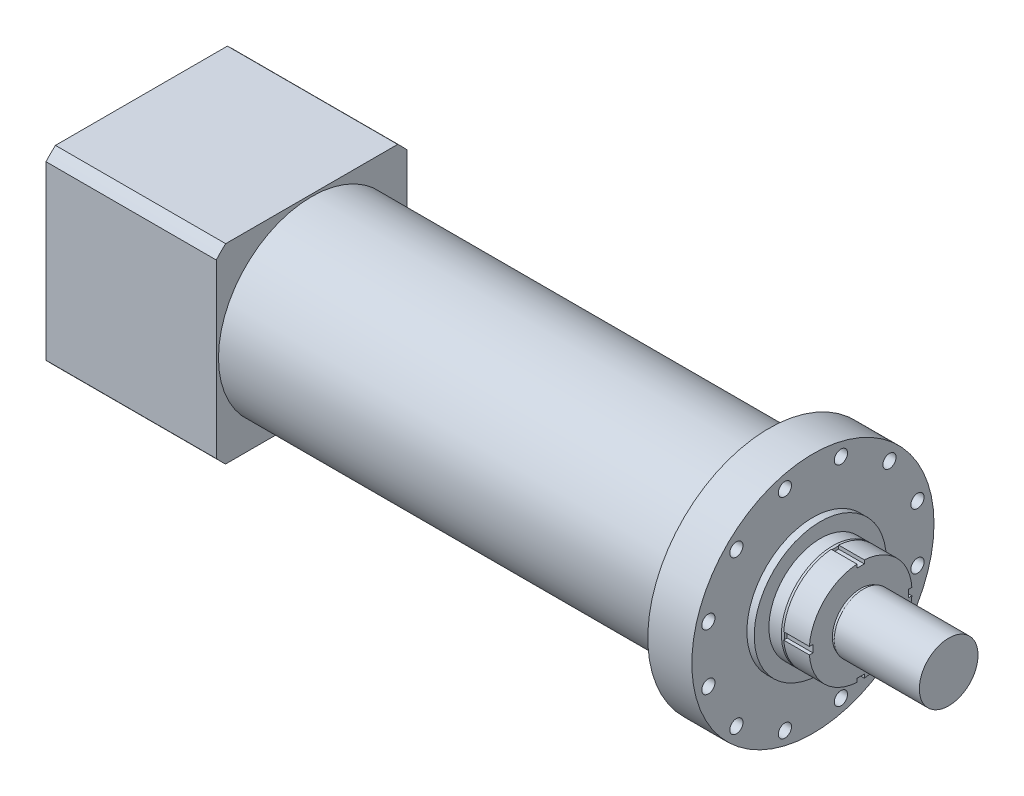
ISO-10303-21;
HEADER;
FILE_DESCRIPTION(('STEP AP214'),'2;1');
FILE_NAME('part.step','',(''),(''),'','','');
FILE_SCHEMA(('AUTOMOTIVE_DESIGN { 1 0 10303 214 1 1 1 1 }'));
ENDSEC;
DATA;
#1=APPLICATION_CONTEXT('core data for automotive mechanical design processes');
#2=APPLICATION_PROTOCOL_DEFINITION('international standard','automotive_design',2000,#1);
#3=PRODUCT_CONTEXT('',#1,'mechanical');
#4=PRODUCT('Part','Part','',(#3));
#5=PRODUCT_RELATED_PRODUCT_CATEGORY('part','',(#4));
#6=PRODUCT_DEFINITION_FORMATION('','',#4);
#7=PRODUCT_DEFINITION_CONTEXT('part definition',#1,'design');
#8=PRODUCT_DEFINITION('design','',#6,#7);
#9=PRODUCT_DEFINITION_SHAPE('','',#8);
#10=(LENGTH_UNIT() NAMED_UNIT(*) SI_UNIT(.MILLI.,.METRE.));
#11=(NAMED_UNIT(*) PLANE_ANGLE_UNIT() SI_UNIT($,.RADIAN.));
#12=(NAMED_UNIT(*) SI_UNIT($,.STERADIAN.) SOLID_ANGLE_UNIT());
#13=UNCERTAINTY_MEASURE_WITH_UNIT(LENGTH_MEASURE(1.E-05),#10,'distance_accuracy_value','');
#14=(GEOMETRIC_REPRESENTATION_CONTEXT(3) GLOBAL_UNCERTAINTY_ASSIGNED_CONTEXT((#13)) GLOBAL_UNIT_ASSIGNED_CONTEXT((#10,
#11,#12)) REPRESENTATION_CONTEXT('',''));
#15=CARTESIAN_POINT('',(0.,0.,0.));
#16=DIRECTION('',(0.,0.,1.));
#17=DIRECTION('',(1.,0.,0.));
#18=AXIS2_PLACEMENT_3D('',#15,#16,#17);
#19=CARTESIAN_POINT('',(748.,0.,0.));
#20=DIRECTION('',(-1.,0.,0.));
#21=DIRECTION('',(0.,0.,1.));
#22=AXIS2_PLACEMENT_3D('',#19,#20,#21);
#23=CYLINDRICAL_SURFACE('',#22,70.);
#24=DIRECTION('',(-1.,0.,0.));
#25=VECTOR('',#24,1.);
#26=CARTESIAN_POINT('',(748.,69.8212002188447,5.));
#27=LINE('',#26,#25);
#28=CARTESIAN_POINT('',(713.,69.8212002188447,5.));
#29=VERTEX_POINT('',#28);
#30=CARTESIAN_POINT('',(748.,69.8212002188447,5.));
#31=VERTEX_POINT('',#30);
#32=EDGE_CURVE('E289',#29,#31,#27,.F.);
#33=ORIENTED_EDGE('',*,*,#32,.F.);
#34=CARTESIAN_POINT('',(713.,0.,0.));
#35=DIRECTION('',(1.,0.,0.));
#36=DIRECTION('',(0.,0.,-1.));
#37=AXIS2_PLACEMENT_3D('',#34,#35,#36);
#38=CIRCLE('',#37,70.);
#39=CARTESIAN_POINT('',(713.,5.,69.8212002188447));
#40=VERTEX_POINT('',#39);
#41=EDGE_CURVE('E315',#29,#40,#38,.T.);
#42=ORIENTED_EDGE('',*,*,#41,.T.);
#43=DIRECTION('',(-1.,0.,0.));
#44=VECTOR('',#43,1.);
#45=CARTESIAN_POINT('',(748.,5.,69.8212002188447));
#46=LINE('',#45,#44);
#47=CARTESIAN_POINT('',(748.,5.,69.8212002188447));
#48=VERTEX_POINT('',#47);
#49=EDGE_CURVE('E278',#48,#40,#46,.T.);
#50=ORIENTED_EDGE('',*,*,#49,.F.);
#51=CARTESIAN_POINT('',(748.,0.,0.));
#52=DIRECTION('',(1.,0.,0.));
#53=DIRECTION('',(0.,0.,-1.));
#54=AXIS2_PLACEMENT_3D('',#51,#52,#53);
#55=CIRCLE('',#54,70.);
#56=EDGE_CURVE('E310',#31,#48,#55,.T.);
#57=ORIENTED_EDGE('',*,*,#56,.F.);
#58=EDGE_LOOP('',(#33,#42,#50,#57));
#59=FACE_BOUND('',#58,.T.);
#60=ADVANCED_FACE('F48',(#59),#23,.T.);
#61=CARTESIAN_POINT('',(713.,5.,-69.8212002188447));
#62=VERTEX_POINT('',#61);
#63=CARTESIAN_POINT('',(713.,69.8212002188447,-5.));
#64=VERTEX_POINT('',#63);
#65=EDGE_CURVE('E312',#62,#64,#38,.T.);
#66=ORIENTED_EDGE('',*,*,#65,.T.);
#67=DIRECTION('',(-1.,0.,0.));
#68=VECTOR('',#67,1.);
#69=CARTESIAN_POINT('',(748.,69.8212002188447,-5.));
#70=LINE('',#69,#68);
#71=CARTESIAN_POINT('',(748.,69.8212002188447,-5.));
#72=VERTEX_POINT('',#71);
#73=EDGE_CURVE('E71',#64,#72,#70,.F.);
#74=ORIENTED_EDGE('',*,*,#73,.T.);
#75=CARTESIAN_POINT('',(748.,5.,-69.8212002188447));
#76=VERTEX_POINT('',#75);
#77=EDGE_CURVE('E306',#76,#72,#55,.T.);
#78=ORIENTED_EDGE('',*,*,#77,.F.);
#79=DIRECTION('',(-1.,0.,0.));
#80=VECTOR('',#79,1.);
#81=CARTESIAN_POINT('',(748.,5.,-69.8212002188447));
#82=LINE('',#81,#80);
#83=EDGE_CURVE('E286',#62,#76,#82,.F.);
#84=ORIENTED_EDGE('',*,*,#83,.F.);
#85=EDGE_LOOP('',(#66,#74,#78,#84));
#86=FACE_BOUND('',#85,.T.);
#87=ADVANCED_FACE('F429',(#86),#23,.T.);
#88=DIRECTION('',(-1.,0.,0.));
#89=VECTOR('',#88,1.);
#90=CARTESIAN_POINT('',(748.,-4.99999999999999,-69.8212002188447));
#91=LINE('',#90,#89);
#92=CARTESIAN_POINT('',(748.,-4.99999999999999,-69.8212002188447));
#93=VERTEX_POINT('',#92);
#94=CARTESIAN_POINT('',(713.,-4.99999999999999,-69.8212002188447));
#95=VERTEX_POINT('',#94);
#96=EDGE_CURVE('E63',#93,#95,#91,.T.);
#97=ORIENTED_EDGE('',*,*,#96,.F.);
#98=CARTESIAN_POINT('',(748.,-69.8212002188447,-5.));
#99=VERTEX_POINT('',#98);
#100=EDGE_CURVE('E311',#99,#93,#55,.T.);
#101=ORIENTED_EDGE('',*,*,#100,.F.);
#102=DIRECTION('',(-1.,0.,0.));
#103=VECTOR('',#102,1.);
#104=CARTESIAN_POINT('',(748.,-69.8212002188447,-5.));
#105=LINE('',#104,#103);
#106=CARTESIAN_POINT('',(713.,-69.8212002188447,-5.));
#107=VERTEX_POINT('',#106);
#108=EDGE_CURVE('E280',#99,#107,#105,.T.);
#109=ORIENTED_EDGE('',*,*,#108,.T.);
#110=EDGE_CURVE('E300',#107,#95,#38,.T.);
#111=ORIENTED_EDGE('',*,*,#110,.T.);
#112=EDGE_LOOP('',(#97,#101,#109,#111));
#113=FACE_BOUND('',#112,.T.);
#114=ADVANCED_FACE('F501',(#113),#23,.T.);
#115=DIRECTION('',(-1.,0.,0.));
#116=VECTOR('',#115,1.);
#117=CARTESIAN_POINT('',(748.,-69.8212002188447,5.));
#118=LINE('',#117,#116);
#119=CARTESIAN_POINT('',(748.,-69.8212002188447,5.));
#120=VERTEX_POINT('',#119);
#121=CARTESIAN_POINT('',(713.,-69.8212002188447,5.));
#122=VERTEX_POINT('',#121);
#123=EDGE_CURVE('E283',#120,#122,#118,.T.);
#124=ORIENTED_EDGE('',*,*,#123,.F.);
#125=CARTESIAN_POINT('',(748.,-5.00000000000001,69.8212002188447));
#126=VERTEX_POINT('',#125);
#127=EDGE_CURVE('E517',#126,#120,#55,.T.);
#128=ORIENTED_EDGE('',*,*,#127,.F.);
#129=DIRECTION('',(-1.,0.,0.));
#130=VECTOR('',#129,1.);
#131=CARTESIAN_POINT('',(748.,-5.00000000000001,69.8212002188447));
#132=LINE('',#131,#130);
#133=CARTESIAN_POINT('',(713.,-5.00000000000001,69.8212002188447));
#134=VERTEX_POINT('',#133);
#135=EDGE_CURVE('E193',#134,#126,#132,.F.);
#136=ORIENTED_EDGE('',*,*,#135,.F.);
#137=EDGE_CURVE('E519',#134,#122,#38,.T.);
#138=ORIENTED_EDGE('',*,*,#137,.T.);
#139=EDGE_LOOP('',(#124,#128,#136,#138));
#140=FACE_BOUND('',#139,.T.);
#141=ADVANCED_FACE('F497',(#140),#23,.T.);
#142=CARTESIAN_POINT('',(748.,0.,0.));
#143=DIRECTION('',(1.,0.,0.));
#144=DIRECTION('',(0.,0.,-1.));
#145=AXIS2_PLACEMENT_3D('',#142,#143,#144);
#146=PLANE('',#145);
#147=CARTESIAN_POINT('',(748.,0.,0.));
#148=DIRECTION('',(1.,0.,0.));
#149=DIRECTION('',(0.,0.,-1.));
#150=AXIS2_PLACEMENT_3D('',#147,#148,#149);
#151=CIRCLE('',#150,38.5);
#152=CARTESIAN_POINT('',(748.,0.,-38.5));
#153=VERTEX_POINT('',#152);
#154=EDGE_CURVE('E301',#153,#153,#151,.T.);
#155=ORIENTED_EDGE('',*,*,#154,.F.);
#156=EDGE_LOOP('',(#155));
#157=FACE_BOUND('',#156,.T.);
#158=DIRECTION('',(0.,0.,-1.));
#159=VECTOR('',#158,1.);
#160=CARTESIAN_POINT('',(748.,65.,5.));
#161=LINE('',#160,#159);
#162=CARTESIAN_POINT('',(748.,65.,5.));
#163=VERTEX_POINT('',#162);
#164=CARTESIAN_POINT('',(748.,65.,-5.));
#165=VERTEX_POINT('',#164);
#166=EDGE_CURVE('E191',#163,#165,#161,.T.);
#167=ORIENTED_EDGE('',*,*,#166,.F.);
#168=DIRECTION('',(0.,1.,0.));
#169=VECTOR('',#168,1.);
#170=CARTESIAN_POINT('',(748.,65.,5.));
#171=LINE('',#170,#169);
#172=EDGE_CURVE('E210',#163,#31,#171,.T.);
#173=ORIENTED_EDGE('',*,*,#172,.T.);
#174=ORIENTED_EDGE('',*,*,#56,.T.);
#175=DIRECTION('',(0.,0.,-1.));
#176=VECTOR('',#175,1.);
#177=CARTESIAN_POINT('',(748.,5.,76.4659316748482));
#178=LINE('',#177,#176);
#179=CARTESIAN_POINT('',(748.,5.,65.));
#180=VERTEX_POINT('',#179);
#181=EDGE_CURVE('E244',#48,#180,#178,.T.);
#182=ORIENTED_EDGE('',*,*,#181,.T.);
#183=DIRECTION('',(0.,-1.,0.));
#184=VECTOR('',#183,1.);
#185=CARTESIAN_POINT('',(748.,5.,65.));
#186=LINE('',#185,#184);
#187=CARTESIAN_POINT('',(748.,-5.00000000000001,65.));
#188=VERTEX_POINT('',#187);
#189=EDGE_CURVE('E267',#180,#188,#186,.T.);
#190=ORIENTED_EDGE('',*,*,#189,.T.);
#191=DIRECTION('',(0.,0.,1.));
#192=VECTOR('',#191,1.);
#193=CARTESIAN_POINT('',(748.,-5.00000000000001,65.));
#194=LINE('',#193,#192);
#195=EDGE_CURVE('E264',#188,#126,#194,.T.);
#196=ORIENTED_EDGE('',*,*,#195,.T.);
#197=ORIENTED_EDGE('',*,*,#127,.T.);
#198=DIRECTION('',(0.,1.,0.));
#199=VECTOR('',#198,1.);
#200=CARTESIAN_POINT('',(748.,-77.2193180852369,5.));
#201=LINE('',#200,#199);
#202=CARTESIAN_POINT('',(748.,-65.,5.));
#203=VERTEX_POINT('',#202);
#204=EDGE_CURVE('E245',#120,#203,#201,.T.);
#205=ORIENTED_EDGE('',*,*,#204,.T.);
#206=DIRECTION('',(0.,0.,-1.));
#207=VECTOR('',#206,1.);
#208=CARTESIAN_POINT('',(748.,-65.,5.));
#209=LINE('',#208,#207);
#210=CARTESIAN_POINT('',(748.,-65.,-5.));
#211=VERTEX_POINT('',#210);
#212=EDGE_CURVE('E248',#203,#211,#209,.T.);
#213=ORIENTED_EDGE('',*,*,#212,.T.);
#214=DIRECTION('',(0.,1.,0.));
#215=VECTOR('',#214,1.);
#216=CARTESIAN_POINT('',(748.,-77.2193180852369,-5.));
#217=LINE('',#216,#215);
#218=EDGE_CURVE('E222',#99,#211,#217,.T.);
#219=ORIENTED_EDGE('',*,*,#218,.F.);
#220=ORIENTED_EDGE('',*,*,#100,.T.);
#221=DIRECTION('',(0.,0.,1.));
#222=VECTOR('',#221,1.);
#223=CARTESIAN_POINT('',(748.,-4.99999999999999,-98.9652028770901));
#224=LINE('',#223,#222);
#225=CARTESIAN_POINT('',(748.,-4.99999999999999,-65.));
#226=VERTEX_POINT('',#225);
#227=EDGE_CURVE('E226',#93,#226,#224,.T.);
#228=ORIENTED_EDGE('',*,*,#227,.T.);
#229=DIRECTION('',(0.,-1.,0.));
#230=VECTOR('',#229,1.);
#231=CARTESIAN_POINT('',(748.,5.,-65.));
#232=LINE('',#231,#230);
#233=CARTESIAN_POINT('',(748.,5.,-65.));
#234=VERTEX_POINT('',#233);
#235=EDGE_CURVE('E214',#234,#226,#232,.T.);
#236=ORIENTED_EDGE('',*,*,#235,.F.);
#237=DIRECTION('',(0.,0.,-1.));
#238=VECTOR('',#237,1.);
#239=CARTESIAN_POINT('',(748.,5.,-65.));
#240=LINE('',#239,#238);
#241=EDGE_CURVE('E223',#234,#76,#240,.T.);
#242=ORIENTED_EDGE('',*,*,#241,.T.);
#243=ORIENTED_EDGE('',*,*,#77,.T.);
#244=DIRECTION('',(0.,1.,0.));
#245=VECTOR('',#244,1.);
#246=CARTESIAN_POINT('',(748.,65.,-5.));
#247=LINE('',#246,#245);
#248=EDGE_CURVE('E213',#165,#72,#247,.T.);
#249=ORIENTED_EDGE('',*,*,#248,.F.);
#250=EDGE_LOOP('',(#167,#173,#174,#182,#190,#196,#197,#205,#213,#219,#220,#228,#236,#242,#243,#249));
#251=FACE_BOUND('',#250,.T.);
#252=ADVANCED_FACE('F436',(#157,#251),#146,.T.);
#253=CARTESIAN_POINT('',(713.,0.,0.));
#254=DIRECTION('',(1.,0.,0.));
#255=DIRECTION('',(0.,0.,-1.));
#256=AXIS2_PLACEMENT_3D('',#253,#254,#255);
#257=PLANE('',#256);
#258=DIRECTION('',(0.,1.,0.));
#259=VECTOR('',#258,1.);
#260=CARTESIAN_POINT('',(713.,0.,5.));
#261=LINE('',#260,#259);
#262=CARTESIAN_POINT('',(713.,68.7264488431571,5.));
#263=VERTEX_POINT('',#262);
#264=EDGE_CURVE('E12',#263,#29,#261,.T.);
#265=ORIENTED_EDGE('',*,*,#264,.F.);
#266=CARTESIAN_POINT('',(713.,0.,0.));
#267=DIRECTION('',(1.,0.,0.));
#268=DIRECTION('',(0.,0.,-1.));
#269=AXIS2_PLACEMENT_3D('',#266,#267,#268);
#270=CIRCLE('',#269,68.9080892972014);
#271=CARTESIAN_POINT('',(713.,5.,68.7264488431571));
#272=VERTEX_POINT('',#271);
#273=EDGE_CURVE('E463',#263,#272,#270,.T.);
#274=ORIENTED_EDGE('',*,*,#273,.T.);
#275=DIRECTION('',(0.,0.,-1.));
#276=VECTOR('',#275,1.);
#277=CARTESIAN_POINT('',(713.,5.,0.));
#278=LINE('',#277,#276);
#279=EDGE_CURVE('E410',#40,#272,#278,.T.);
#280=ORIENTED_EDGE('',*,*,#279,.F.);
#281=ORIENTED_EDGE('',*,*,#41,.F.);
#282=EDGE_LOOP('',(#265,#274,#280,#281));
#283=FACE_BOUND('',#282,.T.);
#284=ADVANCED_FACE('F477',(#283),#257,.F.);
#285=CARTESIAN_POINT('',(713.,5.,-68.7264488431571));
#286=VERTEX_POINT('',#285);
#287=CARTESIAN_POINT('',(713.,68.7264488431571,-5.));
#288=VERTEX_POINT('',#287);
#289=EDGE_CURVE('E403',#286,#288,#270,.T.);
#290=ORIENTED_EDGE('',*,*,#289,.T.);
#291=DIRECTION('',(0.,1.,0.));
#292=VECTOR('',#291,1.);
#293=CARTESIAN_POINT('',(713.,0.,-5.));
#294=LINE('',#293,#292);
#295=EDGE_CURVE('E56',#288,#64,#294,.T.);
#296=ORIENTED_EDGE('',*,*,#295,.T.);
#297=ORIENTED_EDGE('',*,*,#65,.F.);
#298=DIRECTION('',(0.,0.,-1.));
#299=VECTOR('',#298,1.);
#300=CARTESIAN_POINT('',(713.,5.,0.));
#301=LINE('',#300,#299);
#302=EDGE_CURVE('E421',#286,#62,#301,.T.);
#303=ORIENTED_EDGE('',*,*,#302,.F.);
#304=EDGE_LOOP('',(#290,#296,#297,#303));
#305=FACE_BOUND('',#304,.T.);
#306=ADVANCED_FACE('F424',(#305),#257,.F.);
#307=DIRECTION('',(0.,0.,1.));
#308=VECTOR('',#307,1.);
#309=CARTESIAN_POINT('',(713.,-5.,0.));
#310=LINE('',#309,#308);
#311=CARTESIAN_POINT('',(713.,-4.99999999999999,-68.7264488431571));
#312=VERTEX_POINT('',#311);
#313=EDGE_CURVE('E419',#95,#312,#310,.T.);
#314=ORIENTED_EDGE('',*,*,#313,.F.);
#315=ORIENTED_EDGE('',*,*,#110,.F.);
#316=DIRECTION('',(0.,1.,0.));
#317=VECTOR('',#316,1.);
#318=CARTESIAN_POINT('',(713.,0.,-5.));
#319=LINE('',#318,#317);
#320=CARTESIAN_POINT('',(713.,-68.7264488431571,-5.));
#321=VERTEX_POINT('',#320);
#322=EDGE_CURVE('E413',#107,#321,#319,.T.);
#323=ORIENTED_EDGE('',*,*,#322,.T.);
#324=EDGE_CURVE('E449',#321,#312,#270,.T.);
#325=ORIENTED_EDGE('',*,*,#324,.T.);
#326=EDGE_LOOP('',(#314,#315,#323,#325));
#327=FACE_BOUND('',#326,.T.);
#328=ADVANCED_FACE('F549',(#327),#257,.F.);
#329=DIRECTION('',(0.,1.,0.));
#330=VECTOR('',#329,1.);
#331=CARTESIAN_POINT('',(713.,0.,5.));
#332=LINE('',#331,#330);
#333=CARTESIAN_POINT('',(713.,-68.7264488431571,5.));
#334=VERTEX_POINT('',#333);
#335=EDGE_CURVE('E416',#122,#334,#332,.T.);
#336=ORIENTED_EDGE('',*,*,#335,.F.);
#337=ORIENTED_EDGE('',*,*,#137,.F.);
#338=DIRECTION('',(0.,0.,1.));
#339=VECTOR('',#338,1.);
#340=CARTESIAN_POINT('',(713.,-5.00000000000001,0.));
#341=LINE('',#340,#339);
#342=CARTESIAN_POINT('',(713.,-5.00000000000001,68.7264488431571));
#343=VERTEX_POINT('',#342);
#344=EDGE_CURVE('E304',#343,#134,#341,.T.);
#345=ORIENTED_EDGE('',*,*,#344,.F.);
#346=EDGE_CURVE('E453',#343,#334,#270,.T.);
#347=ORIENTED_EDGE('',*,*,#346,.T.);
#348=EDGE_LOOP('',(#336,#337,#345,#347));
#349=FACE_BOUND('',#348,.T.);
#350=ADVANCED_FACE('F538',(#349),#257,.F.);
#351=CARTESIAN_POINT('',(683.,0.,0.));
#352=DIRECTION('',(-1.,0.,0.));
#353=DIRECTION('',(0.,0.,1.));
#354=AXIS2_PLACEMENT_3D('',#351,#352,#353);
#355=CYLINDRICAL_SURFACE('',#354,165.);
#356=CARTESIAN_POINT('',(683.,0.,0.));
#357=DIRECTION('',(1.,0.,0.));
#358=DIRECTION('',(0.,0.,-1.));
#359=AXIS2_PLACEMENT_3D('',#356,#357,#358);
#360=CIRCLE('',#359,165.);
#361=CARTESIAN_POINT('',(683.,0.,-165.));
#362=VERTEX_POINT('',#361);
#363=EDGE_CURVE('E398',#362,#362,#360,.T.);
#364=ORIENTED_EDGE('',*,*,#363,.F.);
#365=EDGE_LOOP('',(#364));
#366=FACE_BOUND('',#365,.T.);
#367=CARTESIAN_POINT('',(623.,0.,0.));
#368=DIRECTION('',(1.,0.,0.));
#369=DIRECTION('',(0.,0.,-1.));
#370=AXIS2_PLACEMENT_3D('',#367,#368,#369);
#371=CIRCLE('',#370,165.);
#372=CARTESIAN_POINT('',(623.,0.,-165.));
#373=VERTEX_POINT('',#372);
#374=EDGE_CURVE('E395',#373,#373,#371,.T.);
#375=ORIENTED_EDGE('',*,*,#374,.T.);
#376=EDGE_LOOP('',(#375));
#377=FACE_BOUND('',#376,.T.);
#378=ADVANCED_FACE('F555',(#366,#377),#355,.T.);
#379=CARTESIAN_POINT('',(683.,0.,0.));
#380=DIRECTION('',(1.,0.,0.));
#381=DIRECTION('',(0.,0.,-1.));
#382=AXIS2_PLACEMENT_3D('',#379,#380,#381);
#383=PLANE('',#382);
#384=CARTESIAN_POINT('',(683.,104.298250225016,-104.298250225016));
#385=DIRECTION('',(1.,0.,0.));
#386=DIRECTION('',(0.,0.,-1.));
#387=AXIS2_PLACEMENT_3D('',#384,#385,#386);
#388=CIRCLE('',#387,9.00000000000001);
#389=CARTESIAN_POINT('',(683.,104.298250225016,-113.298250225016));
#390=VERTEX_POINT('',#389);
#391=EDGE_CURVE('E343',#390,#390,#388,.T.);
#392=ORIENTED_EDGE('',*,*,#391,.F.);
#393=EDGE_LOOP('',(#392));
#394=FACE_BOUND('',#393,.T.);
#395=CARTESIAN_POINT('',(683.,38.1758091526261,-142.474059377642));
#396=DIRECTION('',(1.,0.,0.));
#397=DIRECTION('',(0.,0.,-1.));
#398=AXIS2_PLACEMENT_3D('',#395,#396,#397);
#399=CIRCLE('',#398,9.00000000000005);
#400=CARTESIAN_POINT('',(683.,38.1758091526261,-151.474059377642));
#401=VERTEX_POINT('',#400);
#402=EDGE_CURVE('E349',#401,#401,#399,.T.);
#403=ORIENTED_EDGE('',*,*,#402,.F.);
#404=EDGE_LOOP('',(#403));
#405=FACE_BOUND('',#404,.T.);
#406=CARTESIAN_POINT('',(683.,-38.1758091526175,-142.474059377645));
#407=DIRECTION('',(1.,0.,0.));
#408=DIRECTION('',(0.,0.,-1.));
#409=AXIS2_PLACEMENT_3D('',#406,#407,#408);
#410=CIRCLE('',#409,9.00000000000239);
#411=CARTESIAN_POINT('',(683.,-38.1758091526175,-151.474059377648));
#412=VERTEX_POINT('',#411);
#413=EDGE_CURVE('E355',#412,#412,#410,.T.);
#414=ORIENTED_EDGE('',*,*,#413,.F.);
#415=EDGE_LOOP('',(#414));
#416=FACE_BOUND('',#415,.T.);
#417=CARTESIAN_POINT('',(683.,-104.298250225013,-104.298250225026));
#418=DIRECTION('',(1.,0.,0.));
#419=DIRECTION('',(0.,0.,-1.));
#420=AXIS2_PLACEMENT_3D('',#417,#418,#419);
#421=CIRCLE('',#420,9.00000000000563);
#422=CARTESIAN_POINT('',(683.,-104.298250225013,-113.298250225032));
#423=VERTEX_POINT('',#422);
#424=EDGE_CURVE('E361',#423,#423,#421,.T.);
#425=ORIENTED_EDGE('',*,*,#424,.F.);
#426=EDGE_LOOP('',(#425));
#427=FACE_BOUND('',#426,.T.);
#428=CARTESIAN_POINT('',(683.,-142.474059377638,-38.1758091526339));
#429=DIRECTION('',(1.,0.,0.));
#430=DIRECTION('',(0.,0.,-1.));
#431=AXIS2_PLACEMENT_3D('',#428,#429,#430);
#432=CIRCLE('',#431,9.00000000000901);
#433=CARTESIAN_POINT('',(683.,-142.474059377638,-47.1758091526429));
#434=VERTEX_POINT('',#433);
#435=EDGE_CURVE('E367',#434,#434,#432,.T.);
#436=ORIENTED_EDGE('',*,*,#435,.F.);
#437=EDGE_LOOP('',(#436));
#438=FACE_BOUND('',#437,.T.);
#439=CARTESIAN_POINT('',(683.,-142.474059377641,38.1758091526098));
#440=DIRECTION('',(1.,0.,0.));
#441=DIRECTION('',(0.,0.,-1.));
#442=AXIS2_PLACEMENT_3D('',#439,#440,#441);
#443=CIRCLE('',#442,9.00000000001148);
#444=CARTESIAN_POINT('',(683.,-142.474059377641,29.1758091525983));
#445=VERTEX_POINT('',#444);
#446=EDGE_CURVE('E373',#445,#445,#443,.T.);
#447=ORIENTED_EDGE('',*,*,#446,.F.);
#448=EDGE_LOOP('',(#447));
#449=FACE_BOUND('',#448,.T.);
#450=CARTESIAN_POINT('',(683.,-104.298250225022,104.298250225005));
#451=DIRECTION('',(1.,0.,0.));
#452=DIRECTION('',(0.,0.,-1.));
#453=AXIS2_PLACEMENT_3D('',#450,#451,#452);
#454=CIRCLE('',#453,9.00000000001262);
#455=CARTESIAN_POINT('',(683.,-104.298250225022,95.2982502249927));
#456=VERTEX_POINT('',#455);
#457=EDGE_CURVE('E379',#456,#456,#454,.T.);
#458=ORIENTED_EDGE('',*,*,#457,.F.);
#459=EDGE_LOOP('',(#458));
#460=FACE_BOUND('',#459,.T.);
#461=CARTESIAN_POINT('',(683.,-38.1758091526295,142.47405937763));
#462=DIRECTION('',(1.,0.,0.));
#463=DIRECTION('',(0.,0.,-1.));
#464=AXIS2_PLACEMENT_3D('',#461,#462,#463);
#465=CIRCLE('',#464,9.00000000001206);
#466=CARTESIAN_POINT('',(683.,-38.1758091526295,133.474059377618));
#467=VERTEX_POINT('',#466);
#468=EDGE_CURVE('E324',#467,#467,#465,.T.);
#469=ORIENTED_EDGE('',*,*,#468,.F.);
#470=EDGE_LOOP('',(#469));
#471=FACE_BOUND('',#470,.T.);
#472=CARTESIAN_POINT('',(683.,38.1758091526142,142.474059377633));
#473=DIRECTION('',(1.,0.,0.));
#474=DIRECTION('',(0.,0.,-1.));
#475=AXIS2_PLACEMENT_3D('',#472,#473,#474);
#476=CIRCLE('',#475,9.00000000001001);
#477=CARTESIAN_POINT('',(683.,38.1758091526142,133.474059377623));
#478=VERTEX_POINT('',#477);
#479=EDGE_CURVE('E325',#478,#478,#476,.T.);
#480=ORIENTED_EDGE('',*,*,#479,.F.);
#481=EDGE_LOOP('',(#480));
#482=FACE_BOUND('',#481,.T.);
#483=CARTESIAN_POINT('',(683.,104.29825022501,104.298250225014));
#484=DIRECTION('',(1.,0.,0.));
#485=DIRECTION('',(0.,0.,-1.));
#486=AXIS2_PLACEMENT_3D('',#483,#484,#485);
#487=CIRCLE('',#486,9.00000000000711);
#488=CARTESIAN_POINT('',(683.,104.29825022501,95.2982502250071));
#489=VERTEX_POINT('',#488);
#490=EDGE_CURVE('E331',#489,#489,#487,.T.);
#491=ORIENTED_EDGE('',*,*,#490,.F.);
#492=EDGE_LOOP('',(#491));
#493=FACE_BOUND('',#492,.T.);
#494=CARTESIAN_POINT('',(683.,142.474059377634,38.1758091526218));
#495=DIRECTION('',(1.,0.,0.));
#496=DIRECTION('',(0.,0.,-1.));
#497=AXIS2_PLACEMENT_3D('',#494,#495,#496);
#498=CIRCLE('',#497,9.00000000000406);
#499=CARTESIAN_POINT('',(683.,142.474059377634,29.1758091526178));
#500=VERTEX_POINT('',#499);
#501=EDGE_CURVE('E309',#500,#500,#498,.T.);
#502=ORIENTED_EDGE('',*,*,#501,.F.);
#503=EDGE_LOOP('',(#502));
#504=FACE_BOUND('',#503,.T.);
#505=CARTESIAN_POINT('',(683.,142.474059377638,-38.1758091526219));
#506=DIRECTION('',(1.,0.,0.));
#507=DIRECTION('',(0.,0.,-1.));
#508=AXIS2_PLACEMENT_3D('',#505,#506,#507);
#509=CIRCLE('',#508,9.00000000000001);
#510=CARTESIAN_POINT('',(683.,142.474059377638,-47.1758091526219));
#511=VERTEX_POINT('',#510);
#512=EDGE_CURVE('E342',#511,#511,#509,.T.);
#513=ORIENTED_EDGE('',*,*,#512,.F.);
#514=EDGE_LOOP('',(#513));
#515=FACE_BOUND('',#514,.T.);
#516=CARTESIAN_POINT('',(683.,0.,0.));
#517=DIRECTION('',(1.,0.,0.));
#518=DIRECTION('',(0.,0.,-1.));
#519=AXIS2_PLACEMENT_3D('',#516,#517,#518);
#520=CIRCLE('',#519,90.);
#521=CARTESIAN_POINT('',(683.,0.,-90.));
#522=VERTEX_POINT('',#521);
#523=EDGE_CURVE('E320',#522,#522,#520,.T.);
#524=ORIENTED_EDGE('',*,*,#523,.F.);
#525=EDGE_LOOP('',(#524));
#526=FACE_BOUND('',#525,.T.);
#527=ORIENTED_EDGE('',*,*,#363,.T.);
#528=EDGE_LOOP('',(#527));
#529=FACE_BOUND('',#528,.T.);
#530=ADVANCED_FACE('F892',(#394,#405,#416,#427,#438,#449,#460,#471,#482,#493,#504,#515,#526,
#529),#383,.T.);
#531=CARTESIAN_POINT('',(623.,0.,0.));
#532=DIRECTION('',(1.,0.,0.));
#533=DIRECTION('',(0.,0.,-1.));
#534=AXIS2_PLACEMENT_3D('',#531,#532,#533);
#535=PLANE('',#534);
#536=CARTESIAN_POINT('',(623.,104.298250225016,-104.298250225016));
#537=DIRECTION('',(1.,0.,0.));
#538=DIRECTION('',(0.,0.,-1.));
#539=AXIS2_PLACEMENT_3D('',#536,#537,#538);
#540=CIRCLE('',#539,9.00000000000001);
#541=CARTESIAN_POINT('',(623.,104.298250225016,-113.298250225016));
#542=VERTEX_POINT('',#541);
#543=EDGE_CURVE('E339',#542,#542,#540,.T.);
#544=ORIENTED_EDGE('',*,*,#543,.T.);
#545=EDGE_LOOP('',(#544));
#546=FACE_BOUND('',#545,.T.);
#547=CARTESIAN_POINT('',(623.,38.1758091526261,-142.474059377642));
#548=DIRECTION('',(1.,0.,0.));
#549=DIRECTION('',(0.,0.,-1.));
#550=AXIS2_PLACEMENT_3D('',#547,#548,#549);
#551=CIRCLE('',#550,9.00000000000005);
#552=CARTESIAN_POINT('',(623.,38.1758091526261,-151.474059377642));
#553=VERTEX_POINT('',#552);
#554=EDGE_CURVE('E346',#553,#553,#551,.T.);
#555=ORIENTED_EDGE('',*,*,#554,.T.);
#556=EDGE_LOOP('',(#555));
#557=FACE_BOUND('',#556,.T.);
#558=CARTESIAN_POINT('',(623.,-38.1758091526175,-142.474059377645));
#559=DIRECTION('',(1.,0.,0.));
#560=DIRECTION('',(0.,0.,-1.));
#561=AXIS2_PLACEMENT_3D('',#558,#559,#560);
#562=CIRCLE('',#561,9.00000000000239);
#563=CARTESIAN_POINT('',(623.,-38.1758091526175,-151.474059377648));
#564=VERTEX_POINT('',#563);
#565=EDGE_CURVE('E352',#564,#564,#562,.T.);
#566=ORIENTED_EDGE('',*,*,#565,.T.);
#567=EDGE_LOOP('',(#566));
#568=FACE_BOUND('',#567,.T.);
#569=CARTESIAN_POINT('',(623.,-104.298250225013,-104.298250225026));
#570=DIRECTION('',(1.,0.,0.));
#571=DIRECTION('',(0.,0.,-1.));
#572=AXIS2_PLACEMENT_3D('',#569,#570,#571);
#573=CIRCLE('',#572,9.00000000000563);
#574=CARTESIAN_POINT('',(623.,-104.298250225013,-113.298250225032));
#575=VERTEX_POINT('',#574);
#576=EDGE_CURVE('E358',#575,#575,#573,.T.);
#577=ORIENTED_EDGE('',*,*,#576,.T.);
#578=EDGE_LOOP('',(#577));
#579=FACE_BOUND('',#578,.T.);
#580=CARTESIAN_POINT('',(623.,-142.474059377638,-38.1758091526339));
#581=DIRECTION('',(1.,0.,0.));
#582=DIRECTION('',(0.,0.,-1.));
#583=AXIS2_PLACEMENT_3D('',#580,#581,#582);
#584=CIRCLE('',#583,9.00000000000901);
#585=CARTESIAN_POINT('',(623.,-142.474059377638,-47.1758091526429));
#586=VERTEX_POINT('',#585);
#587=EDGE_CURVE('E364',#586,#586,#584,.T.);
#588=ORIENTED_EDGE('',*,*,#587,.T.);
#589=EDGE_LOOP('',(#588));
#590=FACE_BOUND('',#589,.T.);
#591=CARTESIAN_POINT('',(623.,-142.474059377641,38.1758091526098));
#592=DIRECTION('',(1.,0.,0.));
#593=DIRECTION('',(0.,0.,-1.));
#594=AXIS2_PLACEMENT_3D('',#591,#592,#593);
#595=CIRCLE('',#594,9.00000000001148);
#596=CARTESIAN_POINT('',(623.,-142.474059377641,29.1758091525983));
#597=VERTEX_POINT('',#596);
#598=EDGE_CURVE('E370',#597,#597,#595,.T.);
#599=ORIENTED_EDGE('',*,*,#598,.T.);
#600=EDGE_LOOP('',(#599));
#601=FACE_BOUND('',#600,.T.);
#602=CARTESIAN_POINT('',(623.,-104.298250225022,104.298250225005));
#603=DIRECTION('',(1.,0.,0.));
#604=DIRECTION('',(0.,0.,-1.));
#605=AXIS2_PLACEMENT_3D('',#602,#603,#604);
#606=CIRCLE('',#605,9.00000000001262);
#607=CARTESIAN_POINT('',(623.,-104.298250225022,95.2982502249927));
#608=VERTEX_POINT('',#607);
#609=EDGE_CURVE('E376',#608,#608,#606,.T.);
#610=ORIENTED_EDGE('',*,*,#609,.T.);
#611=EDGE_LOOP('',(#610));
#612=FACE_BOUND('',#611,.T.);
#613=CARTESIAN_POINT('',(623.,-38.1758091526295,142.47405937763));
#614=DIRECTION('',(1.,0.,0.));
#615=DIRECTION('',(0.,0.,-1.));
#616=AXIS2_PLACEMENT_3D('',#613,#614,#615);
#617=CIRCLE('',#616,9.00000000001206);
#618=CARTESIAN_POINT('',(623.,-38.1758091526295,133.474059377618));
#619=VERTEX_POINT('',#618);
#620=EDGE_CURVE('E382',#619,#619,#617,.T.);
#621=ORIENTED_EDGE('',*,*,#620,.T.);
#622=EDGE_LOOP('',(#621));
#623=FACE_BOUND('',#622,.T.);
#624=CARTESIAN_POINT('',(623.,38.1758091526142,142.474059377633));
#625=DIRECTION('',(1.,0.,0.));
#626=DIRECTION('',(0.,0.,-1.));
#627=AXIS2_PLACEMENT_3D('',#624,#625,#626);
#628=CIRCLE('',#627,9.00000000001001);
#629=CARTESIAN_POINT('',(623.,38.1758091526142,133.474059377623));
#630=VERTEX_POINT('',#629);
#631=EDGE_CURVE('E321',#630,#630,#628,.T.);
#632=ORIENTED_EDGE('',*,*,#631,.T.);
#633=EDGE_LOOP('',(#632));
#634=FACE_BOUND('',#633,.T.);
#635=CARTESIAN_POINT('',(623.,104.29825022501,104.298250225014));
#636=DIRECTION('',(1.,0.,0.));
#637=DIRECTION('',(0.,0.,-1.));
#638=AXIS2_PLACEMENT_3D('',#635,#636,#637);
#639=CIRCLE('',#638,9.00000000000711);
#640=CARTESIAN_POINT('',(623.,104.29825022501,95.2982502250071));
#641=VERTEX_POINT('',#640);
#642=EDGE_CURVE('E328',#641,#641,#639,.T.);
#643=ORIENTED_EDGE('',*,*,#642,.T.);
#644=EDGE_LOOP('',(#643));
#645=FACE_BOUND('',#644,.T.);
#646=CARTESIAN_POINT('',(623.,142.474059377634,38.1758091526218));
#647=DIRECTION('',(1.,0.,0.));
#648=DIRECTION('',(0.,0.,-1.));
#649=AXIS2_PLACEMENT_3D('',#646,#647,#648);
#650=CIRCLE('',#649,9.00000000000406);
#651=CARTESIAN_POINT('',(623.,142.474059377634,29.1758091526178));
#652=VERTEX_POINT('',#651);
#653=EDGE_CURVE('E334',#652,#652,#650,.T.);
#654=ORIENTED_EDGE('',*,*,#653,.T.);
#655=EDGE_LOOP('',(#654));
#656=FACE_BOUND('',#655,.T.);
#657=CARTESIAN_POINT('',(623.,142.474059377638,-38.1758091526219));
#658=DIRECTION('',(1.,0.,0.));
#659=DIRECTION('',(0.,0.,-1.));
#660=AXIS2_PLACEMENT_3D('',#657,#658,#659);
#661=CIRCLE('',#660,9.00000000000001);
#662=CARTESIAN_POINT('',(623.,142.474059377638,-47.1758091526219));
#663=VERTEX_POINT('',#662);
#664=EDGE_CURVE('E387',#663,#663,#661,.T.);
#665=ORIENTED_EDGE('',*,*,#664,.T.);
#666=EDGE_LOOP('',(#665));
#667=FACE_BOUND('',#666,.T.);
#668=ORIENTED_EDGE('',*,*,#374,.F.);
#669=EDGE_LOOP('',(#668));
#670=FACE_BOUND('',#669,.T.);
#671=ADVANCED_FACE('F882',(#546,#557,#568,#579,#590,#601,#612,#623,#634,#645,#656,#667,#670),
#535,.F.);
#672=CARTESIAN_POINT('',(693.,0.,0.));
#673=DIRECTION('',(-1.,0.,0.));
#674=DIRECTION('',(0.,0.,1.));
#675=AXIS2_PLACEMENT_3D('',#672,#673,#674);
#676=CYLINDRICAL_SURFACE('',#675,90.);
#677=CARTESIAN_POINT('',(693.,0.,0.));
#678=DIRECTION('',(1.,0.,0.));
#679=DIRECTION('',(0.,0.,-1.));
#680=AXIS2_PLACEMENT_3D('',#677,#678,#679);
#681=CIRCLE('',#680,90.);
#682=CARTESIAN_POINT('',(693.,0.,-90.));
#683=VERTEX_POINT('',#682);
#684=EDGE_CURVE('E390',#683,#683,#681,.T.);
#685=ORIENTED_EDGE('',*,*,#684,.F.);
#686=EDGE_LOOP('',(#685));
#687=FACE_BOUND('',#686,.T.);
#688=ORIENTED_EDGE('',*,*,#523,.T.);
#689=EDGE_LOOP('',(#688));
#690=FACE_BOUND('',#689,.T.);
#691=ADVANCED_FACE('F873',(#687,#690),#676,.T.);
#692=CARTESIAN_POINT('',(693.,0.,0.));
#693=DIRECTION('',(1.,0.,0.));
#694=DIRECTION('',(0.,0.,-1.));
#695=AXIS2_PLACEMENT_3D('',#692,#693,#694);
#696=PLANE('',#695);
#697=CARTESIAN_POINT('',(693.,0.,0.));
#698=DIRECTION('',(1.,0.,0.));
#699=DIRECTION('',(0.,0.,-1.));
#700=AXIS2_PLACEMENT_3D('',#697,#698,#699);
#701=CIRCLE('',#700,70.);
#702=CARTESIAN_POINT('',(693.,0.,-70.));
#703=VERTEX_POINT('',#702);
#704=EDGE_CURVE('E316',#703,#703,#701,.T.);
#705=ORIENTED_EDGE('',*,*,#704,.F.);
#706=EDGE_LOOP('',(#705));
#707=FACE_BOUND('',#706,.T.);
#708=ORIENTED_EDGE('',*,*,#684,.T.);
#709=EDGE_LOOP('',(#708));
#710=FACE_BOUND('',#709,.T.);
#711=ADVANCED_FACE('F864',(#707,#710),#696,.T.);
#712=CARTESIAN_POINT('',(623.,142.474059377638,-38.1758091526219));
#713=DIRECTION('',(1.,0.,0.));
#714=DIRECTION('',(0.,0.,-1.));
#715=AXIS2_PLACEMENT_3D('',#712,#713,#714);
#716=CYLINDRICAL_SURFACE('',#715,9.00000000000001);
#717=ORIENTED_EDGE('',*,*,#664,.F.);
#718=EDGE_LOOP('',(#717));
#719=FACE_BOUND('',#718,.T.);
#720=ORIENTED_EDGE('',*,*,#512,.T.);
#721=EDGE_LOOP('',(#720));
#722=FACE_BOUND('',#721,.T.);
#723=ADVANCED_FACE('F855',(#719,#722),#716,.F.);
#724=CARTESIAN_POINT('',(623.,142.474059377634,38.1758091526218));
#725=DIRECTION('',(1.,0.,0.));
#726=DIRECTION('',(0.,0.,-1.));
#727=AXIS2_PLACEMENT_3D('',#724,#725,#726);
#728=CYLINDRICAL_SURFACE('',#727,9.00000000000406);
#729=ORIENTED_EDGE('',*,*,#653,.F.);
#730=EDGE_LOOP('',(#729));
#731=FACE_BOUND('',#730,.T.);
#732=ORIENTED_EDGE('',*,*,#501,.T.);
#733=EDGE_LOOP('',(#732));
#734=FACE_BOUND('',#733,.T.);
#735=ADVANCED_FACE('F846',(#731,#734),#728,.F.);
#736=CARTESIAN_POINT('',(623.,104.29825022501,104.298250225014));
#737=DIRECTION('',(1.,0.,0.));
#738=DIRECTION('',(0.,0.,-1.));
#739=AXIS2_PLACEMENT_3D('',#736,#737,#738);
#740=CYLINDRICAL_SURFACE('',#739,9.00000000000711);
#741=ORIENTED_EDGE('',*,*,#642,.F.);
#742=EDGE_LOOP('',(#741));
#743=FACE_BOUND('',#742,.T.);
#744=ORIENTED_EDGE('',*,*,#490,.T.);
#745=EDGE_LOOP('',(#744));
#746=FACE_BOUND('',#745,.T.);
#747=ADVANCED_FACE('F837',(#743,#746),#740,.F.);
#748=CARTESIAN_POINT('',(623.,38.1758091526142,142.474059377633));
#749=DIRECTION('',(1.,0.,0.));
#750=DIRECTION('',(0.,0.,-1.));
#751=AXIS2_PLACEMENT_3D('',#748,#749,#750);
#752=CYLINDRICAL_SURFACE('',#751,9.00000000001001);
#753=ORIENTED_EDGE('',*,*,#631,.F.);
#754=EDGE_LOOP('',(#753));
#755=FACE_BOUND('',#754,.T.);
#756=ORIENTED_EDGE('',*,*,#479,.T.);
#757=EDGE_LOOP('',(#756));
#758=FACE_BOUND('',#757,.T.);
#759=ADVANCED_FACE('F828',(#755,#758),#752,.F.);
#760=CARTESIAN_POINT('',(623.,-38.1758091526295,142.47405937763));
#761=DIRECTION('',(1.,0.,0.));
#762=DIRECTION('',(0.,0.,-1.));
#763=AXIS2_PLACEMENT_3D('',#760,#761,#762);
#764=CYLINDRICAL_SURFACE('',#763,9.00000000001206);
#765=ORIENTED_EDGE('',*,*,#620,.F.);
#766=EDGE_LOOP('',(#765));
#767=FACE_BOUND('',#766,.T.);
#768=ORIENTED_EDGE('',*,*,#468,.T.);
#769=EDGE_LOOP('',(#768));
#770=FACE_BOUND('',#769,.T.);
#771=ADVANCED_FACE('F819',(#767,#770),#764,.F.);
#772=CARTESIAN_POINT('',(623.,-104.298250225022,104.298250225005));
#773=DIRECTION('',(1.,0.,0.));
#774=DIRECTION('',(0.,0.,-1.));
#775=AXIS2_PLACEMENT_3D('',#772,#773,#774);
#776=CYLINDRICAL_SURFACE('',#775,9.00000000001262);
#777=ORIENTED_EDGE('',*,*,#609,.F.);
#778=EDGE_LOOP('',(#777));
#779=FACE_BOUND('',#778,.T.);
#780=ORIENTED_EDGE('',*,*,#457,.T.);
#781=EDGE_LOOP('',(#780));
#782=FACE_BOUND('',#781,.T.);
#783=ADVANCED_FACE('F810',(#779,#782),#776,.F.);
#784=CARTESIAN_POINT('',(623.,-142.474059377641,38.1758091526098));
#785=DIRECTION('',(1.,0.,0.));
#786=DIRECTION('',(0.,0.,-1.));
#787=AXIS2_PLACEMENT_3D('',#784,#785,#786);
#788=CYLINDRICAL_SURFACE('',#787,9.00000000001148);
#789=ORIENTED_EDGE('',*,*,#598,.F.);
#790=EDGE_LOOP('',(#789));
#791=FACE_BOUND('',#790,.T.);
#792=ORIENTED_EDGE('',*,*,#446,.T.);
#793=EDGE_LOOP('',(#792));
#794=FACE_BOUND('',#793,.T.);
#795=ADVANCED_FACE('F801',(#791,#794),#788,.F.);
#796=CARTESIAN_POINT('',(623.,-142.474059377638,-38.1758091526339));
#797=DIRECTION('',(1.,0.,0.));
#798=DIRECTION('',(0.,0.,-1.));
#799=AXIS2_PLACEMENT_3D('',#796,#797,#798);
#800=CYLINDRICAL_SURFACE('',#799,9.00000000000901);
#801=ORIENTED_EDGE('',*,*,#587,.F.);
#802=EDGE_LOOP('',(#801));
#803=FACE_BOUND('',#802,.T.);
#804=ORIENTED_EDGE('',*,*,#435,.T.);
#805=EDGE_LOOP('',(#804));
#806=FACE_BOUND('',#805,.T.);
#807=ADVANCED_FACE('F792',(#803,#806),#800,.F.);
#808=CARTESIAN_POINT('',(623.,-104.298250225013,-104.298250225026));
#809=DIRECTION('',(1.,0.,0.));
#810=DIRECTION('',(0.,0.,-1.));
#811=AXIS2_PLACEMENT_3D('',#808,#809,#810);
#812=CYLINDRICAL_SURFACE('',#811,9.00000000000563);
#813=ORIENTED_EDGE('',*,*,#576,.F.);
#814=EDGE_LOOP('',(#813));
#815=FACE_BOUND('',#814,.T.);
#816=ORIENTED_EDGE('',*,*,#424,.T.);
#817=EDGE_LOOP('',(#816));
#818=FACE_BOUND('',#817,.T.);
#819=ADVANCED_FACE('F783',(#815,#818),#812,.F.);
#820=CARTESIAN_POINT('',(623.,-38.1758091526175,-142.474059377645));
#821=DIRECTION('',(1.,0.,0.));
#822=DIRECTION('',(0.,0.,-1.));
#823=AXIS2_PLACEMENT_3D('',#820,#821,#822);
#824=CYLINDRICAL_SURFACE('',#823,9.00000000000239);
#825=ORIENTED_EDGE('',*,*,#565,.F.);
#826=EDGE_LOOP('',(#825));
#827=FACE_BOUND('',#826,.T.);
#828=ORIENTED_EDGE('',*,*,#413,.T.);
#829=EDGE_LOOP('',(#828));
#830=FACE_BOUND('',#829,.T.);
#831=ADVANCED_FACE('F774',(#827,#830),#824,.F.);
#832=CARTESIAN_POINT('',(623.,38.1758091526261,-142.474059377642));
#833=DIRECTION('',(1.,0.,0.));
#834=DIRECTION('',(0.,0.,-1.));
#835=AXIS2_PLACEMENT_3D('',#832,#833,#834);
#836=CYLINDRICAL_SURFACE('',#835,9.00000000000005);
#837=ORIENTED_EDGE('',*,*,#554,.F.);
#838=EDGE_LOOP('',(#837));
#839=FACE_BOUND('',#838,.T.);
#840=ORIENTED_EDGE('',*,*,#402,.T.);
#841=EDGE_LOOP('',(#840));
#842=FACE_BOUND('',#841,.T.);
#843=ADVANCED_FACE('F765',(#839,#842),#836,.F.);
#844=CARTESIAN_POINT('',(623.,104.298250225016,-104.298250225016));
#845=DIRECTION('',(1.,0.,0.));
#846=DIRECTION('',(0.,0.,-1.));
#847=AXIS2_PLACEMENT_3D('',#844,#845,#846);
#848=CYLINDRICAL_SURFACE('',#847,9.00000000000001);
#849=ORIENTED_EDGE('',*,*,#543,.F.);
#850=EDGE_LOOP('',(#849));
#851=FACE_BOUND('',#850,.T.);
#852=ORIENTED_EDGE('',*,*,#391,.T.);
#853=EDGE_LOOP('',(#852));
#854=FACE_BOUND('',#853,.T.);
#855=ADVANCED_FACE('F490',(#851,#854),#848,.F.);
#856=CARTESIAN_POINT('',(713.,0.,0.));
#857=DIRECTION('',(-1.,0.,0.));
#858=DIRECTION('',(0.,0.,1.));
#859=AXIS2_PLACEMENT_3D('',#856,#857,#858);
#860=CYLINDRICAL_SURFACE('',#859,70.);
#861=CARTESIAN_POINT('',(710.,0.,0.));
#862=DIRECTION('',(1.,0.,0.));
#863=DIRECTION('',(0.,0.,-1.));
#864=AXIS2_PLACEMENT_3D('',#861,#862,#863);
#865=CIRCLE('',#864,70.);
#866=CARTESIAN_POINT('',(710.,0.,-70.));
#867=VERTEX_POINT('',#866);
#868=EDGE_CURVE('E305',#867,#867,#865,.F.);
#869=ORIENTED_EDGE('',*,*,#868,.T.);
#870=EDGE_LOOP('',(#869));
#871=FACE_BOUND('',#870,.T.);
#872=ORIENTED_EDGE('',*,*,#704,.T.);
#873=EDGE_LOOP('',(#872));
#874=FACE_BOUND('',#873,.T.);
#875=ADVANCED_FACE('F481',(#871,#874),#860,.T.);
#876=CARTESIAN_POINT('',(713.,0.,0.));
#877=DIRECTION('',(-1.,0.,0.));
#878=DIRECTION('',(0.,0.,1.));
#879=AXIS2_PLACEMENT_3D('',#876,#877,#878);
#880=CONICAL_SURFACE('',#879,68.9080892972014,0.349065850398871);
#881=ORIENTED_EDGE('',*,*,#868,.F.);
#882=EDGE_LOOP('',(#881));
#883=FACE_BOUND('',#882,.T.);
#884=ORIENTED_EDGE('',*,*,#289,.F.);
#885=EDGE_CURVE('E319',#312,#286,#270,.T.);
#886=ORIENTED_EDGE('',*,*,#885,.F.);
#887=ORIENTED_EDGE('',*,*,#324,.F.);
#888=EDGE_CURVE('E450',#334,#321,#270,.T.);
#889=ORIENTED_EDGE('',*,*,#888,.F.);
#890=ORIENTED_EDGE('',*,*,#346,.F.);
#891=EDGE_CURVE('E457',#272,#343,#270,.T.);
#892=ORIENTED_EDGE('',*,*,#891,.F.);
#893=ORIENTED_EDGE('',*,*,#273,.F.);
#894=EDGE_CURVE('E406',#288,#263,#270,.T.);
#895=ORIENTED_EDGE('',*,*,#894,.F.);
#896=EDGE_LOOP('',(#884,#886,#887,#889,#890,#892,#893,#895));
#897=FACE_BOUND('',#896,.T.);
#898=ADVANCED_FACE('F50',(#883,#897),#880,.T.);
#899=CARTESIAN_POINT('',(752.,0.,0.));
#900=DIRECTION('',(-1.,0.,0.));
#901=DIRECTION('',(0.,0.,1.));
#902=AXIS2_PLACEMENT_3D('',#899,#900,#901);
#903=CYLINDRICAL_SURFACE('',#902,38.5);
#904=CARTESIAN_POINT('',(752.,0.,0.));
#905=DIRECTION('',(1.,0.,0.));
#906=DIRECTION('',(0.,0.,-1.));
#907=AXIS2_PLACEMENT_3D('',#904,#905,#906);
#908=CIRCLE('',#907,38.5);
#909=CARTESIAN_POINT('',(752.,0.,-38.5));
#910=VERTEX_POINT('',#909);
#911=EDGE_CURVE('E295',#910,#910,#908,.T.);
#912=ORIENTED_EDGE('',*,*,#911,.F.);
#913=EDGE_LOOP('',(#912));
#914=FACE_BOUND('',#913,.T.);
#915=ORIENTED_EDGE('',*,*,#154,.T.);
#916=EDGE_LOOP('',(#915));
#917=FACE_BOUND('',#916,.T.);
#918=ADVANCED_FACE('F480',(#914,#917),#903,.T.);
#919=CARTESIAN_POINT('',(868.,0.,0.));
#920=DIRECTION('',(-1.,0.,0.));
#921=DIRECTION('',(0.,0.,1.));
#922=AXIS2_PLACEMENT_3D('',#919,#920,#921);
#923=CYLINDRICAL_SURFACE('',#922,40.);
#924=CARTESIAN_POINT('',(868.,0.,0.));
#925=DIRECTION('',(1.,0.,0.));
#926=DIRECTION('',(0.,0.,-1.));
#927=AXIS2_PLACEMENT_3D('',#924,#925,#926);
#928=CIRCLE('',#927,40.);
#929=CARTESIAN_POINT('',(868.,0.,40.));
#930=VERTEX_POINT('',#929);
#931=EDGE_CURVE('E292',#930,#930,#928,.T.);
#932=CARTESIAN_POINT('',(752.,0.,0.));
#933=DIRECTION('',(1.,0.,0.));
#934=DIRECTION('',(0.,0.,-1.));
#935=AXIS2_PLACEMENT_3D('',#932,#933,#934);
#936=CIRCLE('',#935,40.);
#937=CARTESIAN_POINT('',(752.,0.,40.));
#938=VERTEX_POINT('',#937);
#939=EDGE_CURVE('E291',#938,#938,#936,.T.);
#940=CARTESIAN_POINT('',(868.,0.,40.));
#941=CARTESIAN_POINT('',(866.791666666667,0.,40.));
#942=CARTESIAN_POINT('',(865.583333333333,0.,40.));
#943=CARTESIAN_POINT('',(863.166666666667,0.,40.));
#944=CARTESIAN_POINT('',(861.958333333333,0.,40.));
#945=CARTESIAN_POINT('',(859.541666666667,0.,40.));
#946=CARTESIAN_POINT('',(858.333333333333,0.,40.));
#947=CARTESIAN_POINT('',(855.916666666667,0.,40.));
#948=CARTESIAN_POINT('',(854.708333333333,0.,40.));
#949=CARTESIAN_POINT('',(852.291666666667,0.,40.));
#950=CARTESIAN_POINT('',(851.083333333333,0.,40.));
#951=CARTESIAN_POINT('',(848.666666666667,0.,40.));
#952=CARTESIAN_POINT('',(847.458333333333,0.,40.));
#953=CARTESIAN_POINT('',(845.041666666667,0.,40.));
#954=CARTESIAN_POINT('',(843.833333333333,0.,40.));
#955=CARTESIAN_POINT('',(841.416666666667,0.,40.));
#956=CARTESIAN_POINT('',(840.208333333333,0.,40.));
#957=CARTESIAN_POINT('',(837.791666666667,0.,40.));
#958=CARTESIAN_POINT('',(836.583333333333,0.,40.));
#959=CARTESIAN_POINT('',(834.166666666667,0.,40.));
#960=CARTESIAN_POINT('',(832.958333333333,0.,40.));
#961=CARTESIAN_POINT('',(830.541666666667,0.,40.));
#962=CARTESIAN_POINT('',(829.333333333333,0.,40.));
#963=CARTESIAN_POINT('',(826.916666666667,0.,40.));
#964=CARTESIAN_POINT('',(825.708333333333,0.,40.));
#965=CARTESIAN_POINT('',(823.291666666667,0.,40.));
#966=CARTESIAN_POINT('',(822.083333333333,0.,40.));
#967=CARTESIAN_POINT('',(819.666666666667,0.,40.));
#968=CARTESIAN_POINT('',(818.458333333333,0.,40.));
#969=CARTESIAN_POINT('',(816.041666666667,0.,40.));
#970=CARTESIAN_POINT('',(814.833333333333,0.,40.));
#971=CARTESIAN_POINT('',(812.416666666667,0.,40.));
#972=CARTESIAN_POINT('',(811.208333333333,0.,40.));
#973=CARTESIAN_POINT('',(808.791666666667,0.,40.));
#974=CARTESIAN_POINT('',(807.583333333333,0.,40.));
#975=CARTESIAN_POINT('',(805.166666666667,0.,40.));
#976=CARTESIAN_POINT('',(803.958333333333,0.,40.));
#977=CARTESIAN_POINT('',(801.541666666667,0.,40.));
#978=CARTESIAN_POINT('',(800.333333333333,0.,40.));
#979=CARTESIAN_POINT('',(797.916666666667,0.,40.));
#980=CARTESIAN_POINT('',(796.708333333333,0.,40.));
#981=CARTESIAN_POINT('',(794.291666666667,0.,40.));
#982=CARTESIAN_POINT('',(793.083333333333,0.,40.));
#983=CARTESIAN_POINT('',(790.666666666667,0.,40.));
#984=CARTESIAN_POINT('',(789.458333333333,0.,40.));
#985=CARTESIAN_POINT('',(787.041666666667,0.,40.));
#986=CARTESIAN_POINT('',(785.833333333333,0.,40.));
#987=CARTESIAN_POINT('',(783.416666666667,0.,40.));
#988=CARTESIAN_POINT('',(782.208333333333,0.,40.));
#989=CARTESIAN_POINT('',(779.791666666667,0.,40.));
#990=CARTESIAN_POINT('',(778.583333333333,0.,40.));
#991=CARTESIAN_POINT('',(776.166666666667,0.,40.));
#992=CARTESIAN_POINT('',(774.958333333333,0.,40.));
#993=CARTESIAN_POINT('',(772.541666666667,0.,40.));
#994=CARTESIAN_POINT('',(771.333333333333,0.,40.));
#995=CARTESIAN_POINT('',(768.916666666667,0.,40.));
#996=CARTESIAN_POINT('',(767.708333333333,0.,40.));
#997=CARTESIAN_POINT('',(765.291666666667,0.,40.));
#998=CARTESIAN_POINT('',(764.083333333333,0.,40.));
#999=CARTESIAN_POINT('',(761.666666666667,0.,40.));
#1000=CARTESIAN_POINT('',(760.458333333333,0.,40.));
#1001=CARTESIAN_POINT('',(758.041666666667,0.,40.));
#1002=CARTESIAN_POINT('',(756.833333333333,0.,40.));
#1003=CARTESIAN_POINT('',(754.416666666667,0.,40.));
#1004=CARTESIAN_POINT('',(753.208333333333,0.,40.));
#1005=CARTESIAN_POINT('',(752.,0.,40.));
#1006=B_SPLINE_CURVE_WITH_KNOTS('',3,(#940,#941,#942,#943,#944,#945,#946,#947,#948,#949,#950,
#951,#952,#953,#954,#955,#956,#957,#958,#959,#960,#961,#962,#963,#964,#965,#966,#967,#968,#969,
#970,#971,#972,#973,#974,#975,#976,#977,#978,#979,#980,#981,#982,#983,#984,#985,#986,#987,#988,
#989,#990,#991,#992,#993,#994,#995,#996,#997,#998,#999,#1000,#1001,#1002,#1003,#1004,#1005),
.UNSPECIFIED.,.F.,.F.,(4,2,2,2,2,2,2,2,2,2,2,2,2,2,2,2,2,2,2,2,2,2,2,2,2,2,2,2,2,2,2,2,4),(0.,
3.6250000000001,7.25000000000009,10.8750000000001,14.5000000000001,18.1250000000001,21.75,
25.375,29.,32.625,36.25,39.875,43.5000000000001,47.1250000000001,50.7500000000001,
54.3750000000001,58.,61.625,65.25,68.875,72.5,76.125,79.75,83.375,87.0000000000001,
90.6250000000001,94.2500000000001,97.875,101.5,105.125,108.75,112.375,116.),.UNSPECIFIED.);
#1007=EDGE_CURVE('BSEAM487',#930,#938,#1006,.T.);
#1008=ORIENTED_EDGE('',*,*,#931,.F.);
#1009=ORIENTED_EDGE('',*,*,#939,.T.);
#1010=ORIENTED_EDGE('',*,*,#1007,.T.);
#1011=ORIENTED_EDGE('',*,*,#1007,.F.);
#1012=EDGE_LOOP('',(#1008,#1010,#1009,#1011));
#1013=FACE_BOUND('',#1012,.T.);
#1014=ADVANCED_FACE('F487',(#1013),#923,.T.);
#1015=CARTESIAN_POINT('',(868.,0.,0.));
#1016=DIRECTION('',(1.,0.,0.));
#1017=DIRECTION('',(0.,0.,-1.));
#1018=AXIS2_PLACEMENT_3D('',#1015,#1016,#1017);
#1019=PLANE('',#1018);
#1020=ORIENTED_EDGE('',*,*,#931,.T.);
#1021=EDGE_LOOP('',(#1020));
#1022=FACE_BOUND('',#1021,.T.);
#1023=ADVANCED_FACE('F560',(#1022),#1019,.T.);
#1024=CARTESIAN_POINT('',(752.,0.,0.));
#1025=DIRECTION('',(1.,0.,0.));
#1026=DIRECTION('',(0.,0.,-1.));
#1027=AXIS2_PLACEMENT_3D('',#1024,#1025,#1026);
#1028=PLANE('',#1027);
#1029=ORIENTED_EDGE('',*,*,#911,.T.);
#1030=EDGE_LOOP('',(#1029));
#1031=FACE_BOUND('',#1030,.T.);
#1032=ORIENTED_EDGE('',*,*,#939,.F.);
#1033=EDGE_LOOP('',(#1032));
#1034=FACE_BOUND('',#1033,.T.);
#1035=ADVANCED_FACE('F562',(#1031,#1034),#1028,.F.);
#1036=CARTESIAN_POINT('',(713.,0.,0.));
#1037=DIRECTION('',(-1.,0.,0.));
#1038=DIRECTION('',(0.,0.,1.));
#1039=AXIS2_PLACEMENT_3D('',#1036,#1037,#1038);
#1040=PLANE('',#1039);
#1041=ORIENTED_EDGE('',*,*,#891,.T.);
#1042=DIRECTION('',(0.,0.,1.));
#1043=VECTOR('',#1042,1.);
#1044=CARTESIAN_POINT('',(713.,-5.00000000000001,65.));
#1045=LINE('',#1044,#1043);
#1046=CARTESIAN_POINT('',(713.,-5.00000000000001,65.));
#1047=VERTEX_POINT('',#1046);
#1048=EDGE_CURVE('E263',#1047,#343,#1045,.T.);
#1049=ORIENTED_EDGE('',*,*,#1048,.F.);
#1050=DIRECTION('',(0.,-1.,0.));
#1051=VECTOR('',#1050,1.);
#1052=CARTESIAN_POINT('',(713.,5.,65.));
#1053=LINE('',#1052,#1051);
#1054=CARTESIAN_POINT('',(713.,5.,65.));
#1055=VERTEX_POINT('',#1054);
#1056=EDGE_CURVE('E274',#1055,#1047,#1053,.T.);
#1057=ORIENTED_EDGE('',*,*,#1056,.F.);
#1058=DIRECTION('',(0.,0.,-1.));
#1059=VECTOR('',#1058,1.);
#1060=CARTESIAN_POINT('',(713.,5.,76.4659316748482));
#1061=LINE('',#1060,#1059);
#1062=EDGE_CURVE('E268',#272,#1055,#1061,.T.);
#1063=ORIENTED_EDGE('',*,*,#1062,.F.);
#1064=EDGE_LOOP('',(#1041,#1049,#1057,#1063));
#1065=FACE_BOUND('',#1064,.T.);
#1066=ADVANCED_FACE('F565',(#1065),#1040,.F.);
#1067=CARTESIAN_POINT('',(713.,5.,76.4659316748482));
#1068=DIRECTION('',(0.,-1.,0.));
#1069=DIRECTION('',(0.,0.,-1.));
#1070=AXIS2_PLACEMENT_3D('',#1067,#1068,#1069);
#1071=PLANE('',#1070);
#1072=ORIENTED_EDGE('',*,*,#49,.T.);
#1073=ORIENTED_EDGE('',*,*,#279,.T.);
#1074=ORIENTED_EDGE('',*,*,#1062,.T.);
#1075=DIRECTION('',(1.,0.,0.));
#1076=VECTOR('',#1075,1.);
#1077=CARTESIAN_POINT('',(713.,5.,65.));
#1078=LINE('',#1077,#1076);
#1079=EDGE_CURVE('E258',#1055,#180,#1078,.T.);
#1080=ORIENTED_EDGE('',*,*,#1079,.T.);
#1081=ORIENTED_EDGE('',*,*,#181,.F.);
#1082=EDGE_LOOP('',(#1072,#1073,#1074,#1080,#1081));
#1083=FACE_BOUND('',#1082,.T.);
#1084=ADVANCED_FACE('F530',(#1083),#1071,.T.);
#1085=CARTESIAN_POINT('',(713.,-5.00000000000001,65.));
#1086=DIRECTION('',(0.,1.,0.));
#1087=DIRECTION('',(0.,0.,1.));
#1088=AXIS2_PLACEMENT_3D('',#1085,#1086,#1087);
#1089=PLANE('',#1088);
#1090=ORIENTED_EDGE('',*,*,#135,.T.);
#1091=ORIENTED_EDGE('',*,*,#195,.F.);
#1092=DIRECTION('',(1.,0.,0.));
#1093=VECTOR('',#1092,1.);
#1094=CARTESIAN_POINT('',(713.,-5.00000000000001,65.));
#1095=LINE('',#1094,#1093);
#1096=EDGE_CURVE('E261',#1047,#188,#1095,.T.);
#1097=ORIENTED_EDGE('',*,*,#1096,.F.);
#1098=ORIENTED_EDGE('',*,*,#1048,.T.);
#1099=ORIENTED_EDGE('',*,*,#344,.T.);
#1100=EDGE_LOOP('',(#1090,#1091,#1097,#1098,#1099));
#1101=FACE_BOUND('',#1100,.T.);
#1102=ADVANCED_FACE('F537',(#1101),#1089,.T.);
#1103=CARTESIAN_POINT('',(713.,5.,65.));
#1104=DIRECTION('',(0.,0.,1.));
#1105=DIRECTION('',(1.,0.,0.));
#1106=AXIS2_PLACEMENT_3D('',#1103,#1104,#1105);
#1107=PLANE('',#1106);
#1108=ORIENTED_EDGE('',*,*,#189,.F.);
#1109=ORIENTED_EDGE('',*,*,#1079,.F.);
#1110=ORIENTED_EDGE('',*,*,#1056,.T.);
#1111=ORIENTED_EDGE('',*,*,#1096,.T.);
#1112=EDGE_LOOP('',(#1108,#1109,#1110,#1111));
#1113=FACE_BOUND('',#1112,.T.);
#1114=ADVANCED_FACE('F534',(#1113),#1107,.T.);
#1115=CARTESIAN_POINT('',(713.,0.,0.));
#1116=DIRECTION('',(1.,0.,0.));
#1117=DIRECTION('',(0.,0.,-1.));
#1118=AXIS2_PLACEMENT_3D('',#1115,#1116,#1117);
#1119=PLANE('',#1118);
#1120=DIRECTION('',(0.,1.,0.));
#1121=VECTOR('',#1120,1.);
#1122=CARTESIAN_POINT('',(713.,-77.2193180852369,-5.));
#1123=LINE('',#1122,#1121);
#1124=CARTESIAN_POINT('',(713.,-65.,-5.));
#1125=VERTEX_POINT('',#1124);
#1126=EDGE_CURVE('E249',#321,#1125,#1123,.T.);
#1127=ORIENTED_EDGE('',*,*,#1126,.T.);
#1128=DIRECTION('',(0.,0.,-1.));
#1129=VECTOR('',#1128,1.);
#1130=CARTESIAN_POINT('',(713.,-65.,5.));
#1131=LINE('',#1130,#1129);
#1132=CARTESIAN_POINT('',(713.,-65.,5.));
#1133=VERTEX_POINT('',#1132);
#1134=EDGE_CURVE('E254',#1133,#1125,#1131,.T.);
#1135=ORIENTED_EDGE('',*,*,#1134,.F.);
#1136=DIRECTION('',(0.,1.,0.));
#1137=VECTOR('',#1136,1.);
#1138=CARTESIAN_POINT('',(713.,-77.2193180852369,5.));
#1139=LINE('',#1138,#1137);
#1140=EDGE_CURVE('E241',#334,#1133,#1139,.T.);
#1141=ORIENTED_EDGE('',*,*,#1140,.F.);
#1142=ORIENTED_EDGE('',*,*,#888,.T.);
#1143=EDGE_LOOP('',(#1127,#1135,#1141,#1142));
#1144=FACE_BOUND('',#1143,.T.);
#1145=ADVANCED_FACE('F546',(#1144),#1119,.T.);
#1146=CARTESIAN_POINT('',(713.,-77.2193180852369,5.));
#1147=DIRECTION('',(0.,0.,-1.));
#1148=DIRECTION('',(-1.,0.,0.));
#1149=AXIS2_PLACEMENT_3D('',#1146,#1147,#1148);
#1150=PLANE('',#1149);
#1151=ORIENTED_EDGE('',*,*,#123,.T.);
#1152=ORIENTED_EDGE('',*,*,#335,.T.);
#1153=ORIENTED_EDGE('',*,*,#1140,.T.);
#1154=DIRECTION('',(1.,0.,0.));
#1155=VECTOR('',#1154,1.);
#1156=CARTESIAN_POINT('',(713.,-65.,5.));
#1157=LINE('',#1156,#1155);
#1158=EDGE_CURVE('E242',#1133,#203,#1157,.T.);
#1159=ORIENTED_EDGE('',*,*,#1158,.T.);
#1160=ORIENTED_EDGE('',*,*,#204,.F.);
#1161=EDGE_LOOP('',(#1151,#1152,#1153,#1159,#1160));
#1162=FACE_BOUND('',#1161,.T.);
#1163=ADVANCED_FACE('F539',(#1162),#1150,.T.);
#1164=CARTESIAN_POINT('',(713.,-77.2193180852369,-5.));
#1165=DIRECTION('',(0.,0.,-1.));
#1166=DIRECTION('',(-1.,0.,0.));
#1167=AXIS2_PLACEMENT_3D('',#1164,#1165,#1166);
#1168=PLANE('',#1167);
#1169=ORIENTED_EDGE('',*,*,#218,.T.);
#1170=DIRECTION('',(1.,0.,0.));
#1171=VECTOR('',#1170,1.);
#1172=CARTESIAN_POINT('',(713.,-65.,-5.));
#1173=LINE('',#1172,#1171);
#1174=EDGE_CURVE('E238',#1125,#211,#1173,.T.);
#1175=ORIENTED_EDGE('',*,*,#1174,.F.);
#1176=ORIENTED_EDGE('',*,*,#1126,.F.);
#1177=ORIENTED_EDGE('',*,*,#322,.F.);
#1178=ORIENTED_EDGE('',*,*,#108,.F.);
#1179=EDGE_LOOP('',(#1169,#1175,#1176,#1177,#1178));
#1180=FACE_BOUND('',#1179,.T.);
#1181=ADVANCED_FACE('F548',(#1180),#1168,.F.);
#1182=CARTESIAN_POINT('',(713.,-65.,5.));
#1183=DIRECTION('',(0.,-1.,0.));
#1184=DIRECTION('',(0.,0.,-1.));
#1185=AXIS2_PLACEMENT_3D('',#1182,#1183,#1184);
#1186=PLANE('',#1185);
#1187=ORIENTED_EDGE('',*,*,#212,.F.);
#1188=ORIENTED_EDGE('',*,*,#1158,.F.);
#1189=ORIENTED_EDGE('',*,*,#1134,.T.);
#1190=ORIENTED_EDGE('',*,*,#1174,.T.);
#1191=EDGE_LOOP('',(#1187,#1188,#1189,#1190));
#1192=FACE_BOUND('',#1191,.T.);
#1193=ADVANCED_FACE('F544',(#1192),#1186,.T.);
#1194=CARTESIAN_POINT('',(713.,0.,0.));
#1195=DIRECTION('',(-1.,0.,0.));
#1196=DIRECTION('',(0.,0.,1.));
#1197=AXIS2_PLACEMENT_3D('',#1194,#1195,#1196);
#1198=PLANE('',#1197);
#1199=ORIENTED_EDGE('',*,*,#885,.T.);
#1200=DIRECTION('',(0.,0.,-1.));
#1201=VECTOR('',#1200,1.);
#1202=CARTESIAN_POINT('',(713.,5.,-65.));
#1203=LINE('',#1202,#1201);
#1204=CARTESIAN_POINT('',(713.,5.,-65.));
#1205=VERTEX_POINT('',#1204);
#1206=EDGE_CURVE('E219',#1205,#286,#1203,.T.);
#1207=ORIENTED_EDGE('',*,*,#1206,.F.);
#1208=DIRECTION('',(0.,-1.,0.));
#1209=VECTOR('',#1208,1.);
#1210=CARTESIAN_POINT('',(713.,5.,-65.));
#1211=LINE('',#1210,#1209);
#1212=CARTESIAN_POINT('',(713.,-4.99999999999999,-65.));
#1213=VERTEX_POINT('',#1212);
#1214=EDGE_CURVE('E227',#1205,#1213,#1211,.T.);
#1215=ORIENTED_EDGE('',*,*,#1214,.T.);
#1216=DIRECTION('',(0.,0.,1.));
#1217=VECTOR('',#1216,1.);
#1218=CARTESIAN_POINT('',(713.,-4.99999999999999,-98.9652028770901));
#1219=LINE('',#1218,#1217);
#1220=EDGE_CURVE('E234',#312,#1213,#1219,.T.);
#1221=ORIENTED_EDGE('',*,*,#1220,.F.);
#1222=EDGE_LOOP('',(#1199,#1207,#1215,#1221));
#1223=FACE_BOUND('',#1222,.T.);
#1224=ADVANCED_FACE('F444',(#1223),#1198,.F.);
#1225=CARTESIAN_POINT('',(713.,5.,-65.));
#1226=DIRECTION('',(0.,-1.,0.));
#1227=DIRECTION('',(0.,0.,-1.));
#1228=AXIS2_PLACEMENT_3D('',#1225,#1226,#1227);
#1229=PLANE('',#1228);
#1230=ORIENTED_EDGE('',*,*,#83,.T.);
#1231=ORIENTED_EDGE('',*,*,#241,.F.);
#1232=DIRECTION('',(1.,0.,0.));
#1233=VECTOR('',#1232,1.);
#1234=CARTESIAN_POINT('',(713.,5.,-65.));
#1235=LINE('',#1234,#1233);
#1236=EDGE_CURVE('E220',#1205,#234,#1235,.T.);
#1237=ORIENTED_EDGE('',*,*,#1236,.F.);
#1238=ORIENTED_EDGE('',*,*,#1206,.T.);
#1239=ORIENTED_EDGE('',*,*,#302,.T.);
#1240=EDGE_LOOP('',(#1230,#1231,#1237,#1238,#1239));
#1241=FACE_BOUND('',#1240,.T.);
#1242=ADVANCED_FACE('F433',(#1241),#1229,.T.);
#1243=CARTESIAN_POINT('',(713.,-4.99999999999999,-98.9652028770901));
#1244=DIRECTION('',(0.,1.,0.));
#1245=DIRECTION('',(0.,0.,1.));
#1246=AXIS2_PLACEMENT_3D('',#1243,#1244,#1245);
#1247=PLANE('',#1246);
#1248=ORIENTED_EDGE('',*,*,#96,.T.);
#1249=ORIENTED_EDGE('',*,*,#313,.T.);
#1250=ORIENTED_EDGE('',*,*,#1220,.T.);
#1251=DIRECTION('',(1.,0.,0.));
#1252=VECTOR('',#1251,1.);
#1253=CARTESIAN_POINT('',(713.,-4.99999999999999,-65.));
#1254=LINE('',#1253,#1252);
#1255=EDGE_CURVE('E217',#1213,#226,#1254,.T.);
#1256=ORIENTED_EDGE('',*,*,#1255,.T.);
#1257=ORIENTED_EDGE('',*,*,#227,.F.);
#1258=EDGE_LOOP('',(#1248,#1249,#1250,#1256,#1257));
#1259=FACE_BOUND('',#1258,.T.);
#1260=ADVANCED_FACE('F590',(#1259),#1247,.T.);
#1261=CARTESIAN_POINT('',(713.,5.,-65.));
#1262=DIRECTION('',(0.,0.,1.));
#1263=DIRECTION('',(1.,0.,0.));
#1264=AXIS2_PLACEMENT_3D('',#1261,#1262,#1263);
#1265=PLANE('',#1264);
#1266=ORIENTED_EDGE('',*,*,#235,.T.);
#1267=ORIENTED_EDGE('',*,*,#1255,.F.);
#1268=ORIENTED_EDGE('',*,*,#1214,.F.);
#1269=ORIENTED_EDGE('',*,*,#1236,.T.);
#1270=EDGE_LOOP('',(#1266,#1267,#1268,#1269));
#1271=FACE_BOUND('',#1270,.T.);
#1272=ADVANCED_FACE('F440',(#1271),#1265,.F.);
#1273=CARTESIAN_POINT('',(713.,0.,0.));
#1274=DIRECTION('',(-1.,0.,0.));
#1275=DIRECTION('',(0.,0.,1.));
#1276=AXIS2_PLACEMENT_3D('',#1273,#1274,#1275);
#1277=PLANE('',#1276);
#1278=ORIENTED_EDGE('',*,*,#894,.T.);
#1279=DIRECTION('',(0.,1.,0.));
#1280=VECTOR('',#1279,1.);
#1281=CARTESIAN_POINT('',(713.,65.,5.));
#1282=LINE('',#1281,#1280);
#1283=CARTESIAN_POINT('',(713.,65.,5.));
#1284=VERTEX_POINT('',#1283);
#1285=EDGE_CURVE('E201',#1284,#263,#1282,.T.);
#1286=ORIENTED_EDGE('',*,*,#1285,.F.);
#1287=DIRECTION('',(0.,0.,-1.));
#1288=VECTOR('',#1287,1.);
#1289=CARTESIAN_POINT('',(713.,65.,5.));
#1290=LINE('',#1289,#1288);
#1291=CARTESIAN_POINT('',(713.,65.,-5.));
#1292=VERTEX_POINT('',#1291);
#1293=EDGE_CURVE('E189',#1284,#1292,#1290,.T.);
#1294=ORIENTED_EDGE('',*,*,#1293,.T.);
#1295=DIRECTION('',(0.,1.,0.));
#1296=VECTOR('',#1295,1.);
#1297=CARTESIAN_POINT('',(713.,65.,-5.));
#1298=LINE('',#1297,#1296);
#1299=EDGE_CURVE('E197',#1292,#288,#1298,.T.);
#1300=ORIENTED_EDGE('',*,*,#1299,.T.);
#1301=EDGE_LOOP('',(#1278,#1286,#1294,#1300));
#1302=FACE_BOUND('',#1301,.T.);
#1303=ADVANCED_FACE('F204',(#1302),#1277,.F.);
#1304=CARTESIAN_POINT('',(713.,65.,5.));
#1305=DIRECTION('',(0.,0.,-1.));
#1306=DIRECTION('',(-1.,0.,0.));
#1307=AXIS2_PLACEMENT_3D('',#1304,#1305,#1306);
#1308=PLANE('',#1307);
#1309=ORIENTED_EDGE('',*,*,#32,.T.);
#1310=ORIENTED_EDGE('',*,*,#172,.F.);
#1311=DIRECTION('',(1.,0.,0.));
#1312=VECTOR('',#1311,1.);
#1313=CARTESIAN_POINT('',(713.,65.,5.));
#1314=LINE('',#1313,#1312);
#1315=EDGE_CURVE('E194',#1284,#163,#1314,.T.);
#1316=ORIENTED_EDGE('',*,*,#1315,.F.);
#1317=ORIENTED_EDGE('',*,*,#1285,.T.);
#1318=ORIENTED_EDGE('',*,*,#264,.T.);
#1319=EDGE_LOOP('',(#1309,#1310,#1316,#1317,#1318));
#1320=FACE_BOUND('',#1319,.T.);
#1321=ADVANCED_FACE('F473',(#1320),#1308,.T.);
#1322=CARTESIAN_POINT('',(713.,65.,-5.));
#1323=DIRECTION('',(0.,0.,-1.));
#1324=DIRECTION('',(-1.,0.,0.));
#1325=AXIS2_PLACEMENT_3D('',#1322,#1323,#1324);
#1326=PLANE('',#1325);
#1327=ORIENTED_EDGE('',*,*,#295,.F.);
#1328=ORIENTED_EDGE('',*,*,#1299,.F.);
#1329=DIRECTION('',(1.,0.,0.));
#1330=VECTOR('',#1329,1.);
#1331=CARTESIAN_POINT('',(713.,65.,-5.));
#1332=LINE('',#1331,#1330);
#1333=EDGE_CURVE('E185',#1292,#165,#1332,.T.);
#1334=ORIENTED_EDGE('',*,*,#1333,.T.);
#1335=ORIENTED_EDGE('',*,*,#248,.T.);
#1336=ORIENTED_EDGE('',*,*,#73,.F.);
#1337=EDGE_LOOP('',(#1327,#1328,#1334,#1335,#1336));
#1338=FACE_BOUND('',#1337,.T.);
#1339=ADVANCED_FACE('F198',(#1338),#1326,.F.);
#1340=CARTESIAN_POINT('',(713.,65.,5.));
#1341=DIRECTION('',(0.,-1.,0.));
#1342=DIRECTION('',(0.,0.,-1.));
#1343=AXIS2_PLACEMENT_3D('',#1340,#1341,#1342);
#1344=PLANE('',#1343);
#1345=ORIENTED_EDGE('',*,*,#166,.T.);
#1346=ORIENTED_EDGE('',*,*,#1333,.F.);
#1347=ORIENTED_EDGE('',*,*,#1293,.F.);
#1348=ORIENTED_EDGE('',*,*,#1315,.T.);
#1349=EDGE_LOOP('',(#1345,#1346,#1347,#1348));
#1350=FACE_BOUND('',#1349,.T.);
#1351=ADVANCED_FACE('F187',(#1350),#1344,.F.);
#1352=CLOSED_SHELL('',(#60,#87,#114,#141,#252,#284,#306,#328,#350,#378,#530,#671,#691,#711,#723,
#735,#747,#759,#771,#783,#795,#807,#819,#831,#843,#855,#875,#898,#918,#1014,#1023,#1035,#1066,
#1084,#1102,#1114,#1145,#1163,#1181,#1193,#1224,#1242,#1260,#1272,#1303,#1321,#1339,#1351));
#1353=MANIFOLD_SOLID_BREP('B2',#1352);
#1354=CARTESIAN_POINT('',(623.,0.,0.));
#1355=DIRECTION('',(1.,0.,0.));
#1356=DIRECTION('',(0.,0.,-1.));
#1357=AXIS2_PLACEMENT_3D('',#1354,#1355,#1356);
#1358=PLANE('',#1357);
#1359=CARTESIAN_POINT('',(623.,0.,0.));
#1360=DIRECTION('',(1.,0.,0.));
#1361=DIRECTION('',(0.,0.,-1.));
#1362=AXIS2_PLACEMENT_3D('',#1359,#1360,#1361);
#1363=CIRCLE('',#1362,127.);
#1364=CARTESIAN_POINT('',(623.,0.,-127.));
#1365=VERTEX_POINT('',#1364);
#1366=EDGE_CURVE('E46',#1365,#1365,#1363,.T.);
#1367=ORIENTED_EDGE('',*,*,#1366,.T.);
#1368=EDGE_LOOP('',(#1367));
#1369=FACE_BOUND('',#1368,.T.);
#1370=CARTESIAN_POINT('',(623.,0.,0.));
#1371=DIRECTION('',(1.,0.,0.));
#1372=DIRECTION('',(0.,0.,-1.));
#1373=AXIS2_PLACEMENT_3D('',#1370,#1371,#1372);
#1374=CIRCLE('',#1373,110.);
#1375=CARTESIAN_POINT('',(623.,0.,-110.));
#1376=VERTEX_POINT('',#1375);
#1377=EDGE_CURVE('E1036',#1376,#1376,#1374,.T.);
#1378=ORIENTED_EDGE('',*,*,#1377,.F.);
#1379=EDGE_LOOP('',(#1378));
#1380=FACE_BOUND('',#1379,.T.);
#1381=ADVANCED_FACE('F1027',(#1369,#1380),#1358,.T.);
#1382=CARTESIAN_POINT('',(623.,0.,0.));
#1383=DIRECTION('',(-1.,0.,0.));
#1384=DIRECTION('',(0.,0.,1.));
#1385=AXIS2_PLACEMENT_3D('',#1382,#1383,#1384);
#1386=CYLINDRICAL_SURFACE('',#1385,127.);
#1387=ORIENTED_EDGE('',*,*,#1366,.F.);
#1388=EDGE_LOOP('',(#1387));
#1389=FACE_BOUND('',#1388,.T.);
#1390=CARTESIAN_POINT('',(0.,0.,0.));
#1391=DIRECTION('',(1.,0.,0.));
#1392=DIRECTION('',(0.,0.,-1.));
#1393=AXIS2_PLACEMENT_3D('',#1390,#1391,#1392);
#1394=CIRCLE('',#1393,127.);
#1395=CARTESIAN_POINT('',(0.,0.,-127.));
#1396=VERTEX_POINT('',#1395);
#1397=EDGE_CURVE('E1031',#1396,#1396,#1394,.T.);
#1398=ORIENTED_EDGE('',*,*,#1397,.T.);
#1399=EDGE_LOOP('',(#1398));
#1400=FACE_BOUND('',#1399,.T.);
#1401=ADVANCED_FACE('F1029',(#1389,#1400),#1386,.T.);
#1402=CARTESIAN_POINT('',(623.,0.,0.));
#1403=DIRECTION('',(-1.,0.,0.));
#1404=DIRECTION('',(0.,0.,1.));
#1405=AXIS2_PLACEMENT_3D('',#1402,#1403,#1404);
#1406=CYLINDRICAL_SURFACE('',#1405,110.);
#1407=ORIENTED_EDGE('',*,*,#1377,.T.);
#1408=EDGE_LOOP('',(#1407));
#1409=FACE_BOUND('',#1408,.T.);
#1410=CARTESIAN_POINT('',(0.,0.,0.));
#1411=DIRECTION('',(1.,0.,0.));
#1412=DIRECTION('',(0.,0.,-1.));
#1413=AXIS2_PLACEMENT_3D('',#1410,#1411,#1412);
#1414=CIRCLE('',#1413,110.);
#1415=CARTESIAN_POINT('',(0.,0.,-110.));
#1416=VERTEX_POINT('',#1415);
#1417=EDGE_CURVE('E1164',#1416,#1416,#1414,.T.);
#1418=ORIENTED_EDGE('',*,*,#1417,.F.);
#1419=EDGE_LOOP('',(#1418));
#1420=FACE_BOUND('',#1419,.T.);
#1421=ADVANCED_FACE('F1186',(#1409,#1420),#1406,.F.);
#1422=CARTESIAN_POINT('',(0.,0.,0.));
#1423=DIRECTION('',(1.,0.,0.));
#1424=DIRECTION('',(0.,0.,-1.));
#1425=AXIS2_PLACEMENT_3D('',#1422,#1423,#1424);
#1426=PLANE('',#1425);
#1427=ORIENTED_EDGE('',*,*,#1417,.T.);
#1428=EDGE_LOOP('',(#1427));
#1429=FACE_BOUND('',#1428,.T.);
#1430=ADVANCED_FACE('F1175',(#1429),#1426,.T.);
#1431=CARTESIAN_POINT('',(0.,0.,0.));
#1432=DIRECTION('',(-1.,0.,0.));
#1433=DIRECTION('',(0.,0.,1.));
#1434=AXIS2_PLACEMENT_3D('',#1431,#1432,#1433);
#1435=CYLINDRICAL_SURFACE('',#1434,175.);
#1436=DIRECTION('',(-1.,0.,0.));
#1437=VECTOR('',#1436,1.);
#1438=CARTESIAN_POINT('',(0.,-130.,-117.1537451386));
#1439=LINE('',#1438,#1437);
#1440=CARTESIAN_POINT('',(0.,-130.,-117.1537451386));
#1441=VERTEX_POINT('',#1440);
#1442=CARTESIAN_POINT('',(-232.,-130.,-117.1537451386));
#1443=VERTEX_POINT('',#1442);
#1444=EDGE_CURVE('E1093',#1441,#1443,#1439,.T.);
#1445=ORIENTED_EDGE('',*,*,#1444,.T.);
#1446=CARTESIAN_POINT('',(-232.,0.,0.));
#1447=DIRECTION('',(-1.,0.,0.));
#1448=DIRECTION('',(0.,0.,1.));
#1449=AXIS2_PLACEMENT_3D('',#1446,#1447,#1448);
#1450=CIRCLE('',#1449,175.);
#1451=CARTESIAN_POINT('',(-232.,-117.1537451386,-130.));
#1452=VERTEX_POINT('',#1451);
#1453=EDGE_CURVE('E1098',#1452,#1443,#1450,.T.);
#1454=ORIENTED_EDGE('',*,*,#1453,.F.);
#1455=DIRECTION('',(-1.,0.,0.));
#1456=VECTOR('',#1455,1.);
#1457=CARTESIAN_POINT('',(0.,-117.1537451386,-130.));
#1458=LINE('',#1457,#1456);
#1459=CARTESIAN_POINT('',(0.,-117.1537451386,-130.));
#1460=VERTEX_POINT('',#1459);
#1461=EDGE_CURVE('E1160',#1460,#1452,#1458,.T.);
#1462=ORIENTED_EDGE('',*,*,#1461,.F.);
#1463=CARTESIAN_POINT('',(0.,0.,0.));
#1464=DIRECTION('',(1.,0.,0.));
#1465=DIRECTION('',(0.,0.,-1.));
#1466=AXIS2_PLACEMENT_3D('',#1463,#1464,#1465);
#1467=CIRCLE('',#1466,175.);
#1468=EDGE_CURVE('E1099',#1441,#1460,#1467,.T.);
#1469=ORIENTED_EDGE('',*,*,#1468,.F.);
#1470=EDGE_LOOP('',(#1445,#1454,#1462,#1469));
#1471=FACE_BOUND('',#1470,.T.);
#1472=ADVANCED_FACE('F1095',(#1471),#1435,.T.);
#1473=CARTESIAN_POINT('',(0.,117.1537451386,-130.));
#1474=DIRECTION('',(0.,0.,1.));
#1475=DIRECTION('',(0.,-1.,0.));
#1476=AXIS2_PLACEMENT_3D('',#1473,#1474,#1475);
#1477=PLANE('',#1476);
#1478=DIRECTION('',(-1.,0.,0.));
#1479=VECTOR('',#1478,1.);
#1480=CARTESIAN_POINT('',(0.,117.1537451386,-130.));
#1481=LINE('',#1480,#1479);
#1482=CARTESIAN_POINT('',(0.,117.1537451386,-130.));
#1483=VERTEX_POINT('',#1482);
#1484=CARTESIAN_POINT('',(-232.,117.1537451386,-130.));
#1485=VERTEX_POINT('',#1484);
#1486=EDGE_CURVE('E1158',#1483,#1485,#1481,.T.);
#1487=ORIENTED_EDGE('',*,*,#1486,.F.);
#1488=DIRECTION('',(0.,1.,0.));
#1489=VECTOR('',#1488,1.);
#1490=CARTESIAN_POINT('',(0.,117.1537451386,-130.));
#1491=LINE('',#1490,#1489);
#1492=EDGE_CURVE('E1137',#1460,#1483,#1491,.T.);
#1493=ORIENTED_EDGE('',*,*,#1492,.F.);
#1494=ORIENTED_EDGE('',*,*,#1461,.T.);
#1495=DIRECTION('',(0.,-1.,0.));
#1496=VECTOR('',#1495,1.);
#1497=CARTESIAN_POINT('',(-232.,117.1537451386,-130.));
#1498=LINE('',#1497,#1496);
#1499=EDGE_CURVE('E1115',#1485,#1452,#1498,.T.);
#1500=ORIENTED_EDGE('',*,*,#1499,.F.);
#1501=EDGE_LOOP('',(#1487,#1493,#1494,#1500));
#1502=FACE_BOUND('',#1501,.T.);
#1503=ADVANCED_FACE('F1200',(#1502),#1477,.F.);
#1504=CARTESIAN_POINT('',(0.,0.,0.));
#1505=DIRECTION('',(-1.,0.,0.));
#1506=DIRECTION('',(0.,0.,1.));
#1507=AXIS2_PLACEMENT_3D('',#1504,#1505,#1506);
#1508=CYLINDRICAL_SURFACE('',#1507,175.);
#1509=ORIENTED_EDGE('',*,*,#1486,.T.);
#1510=CARTESIAN_POINT('',(-232.,0.,0.));
#1511=DIRECTION('',(-1.,0.,0.));
#1512=DIRECTION('',(0.,0.,1.));
#1513=AXIS2_PLACEMENT_3D('',#1510,#1511,#1512);
#1514=CIRCLE('',#1513,175.);
#1515=CARTESIAN_POINT('',(-232.,130.,-117.1537451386));
#1516=VERTEX_POINT('',#1515);
#1517=EDGE_CURVE('E1133',#1516,#1485,#1514,.T.);
#1518=ORIENTED_EDGE('',*,*,#1517,.F.);
#1519=DIRECTION('',(-1.,0.,0.));
#1520=VECTOR('',#1519,1.);
#1521=CARTESIAN_POINT('',(0.,130.,-117.1537451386));
#1522=LINE('',#1521,#1520);
#1523=CARTESIAN_POINT('',(0.,130.,-117.1537451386));
#1524=VERTEX_POINT('',#1523);
#1525=EDGE_CURVE('E1156',#1524,#1516,#1522,.T.);
#1526=ORIENTED_EDGE('',*,*,#1525,.F.);
#1527=CARTESIAN_POINT('',(0.,0.,0.));
#1528=DIRECTION('',(1.,0.,0.));
#1529=DIRECTION('',(0.,0.,-1.));
#1530=AXIS2_PLACEMENT_3D('',#1527,#1528,#1529);
#1531=CIRCLE('',#1530,175.);
#1532=EDGE_CURVE('E1139',#1483,#1524,#1531,.T.);
#1533=ORIENTED_EDGE('',*,*,#1532,.F.);
#1534=EDGE_LOOP('',(#1509,#1518,#1526,#1533));
#1535=FACE_BOUND('',#1534,.T.);
#1536=ADVANCED_FACE('F1203',(#1535),#1508,.T.);
#1537=CARTESIAN_POINT('',(0.,130.,117.1537451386));
#1538=DIRECTION('',(0.,-1.,0.));
#1539=DIRECTION('',(0.,0.,-1.));
#1540=AXIS2_PLACEMENT_3D('',#1537,#1538,#1539);
#1541=PLANE('',#1540);
#1542=DIRECTION('',(-1.,0.,0.));
#1543=VECTOR('',#1542,1.);
#1544=CARTESIAN_POINT('',(0.,130.,117.1537451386));
#1545=LINE('',#1544,#1543);
#1546=CARTESIAN_POINT('',(0.,130.,117.1537451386));
#1547=VERTEX_POINT('',#1546);
#1548=CARTESIAN_POINT('',(-232.,130.,117.1537451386));
#1549=VERTEX_POINT('',#1548);
#1550=EDGE_CURVE('E1154',#1547,#1549,#1545,.T.);
#1551=ORIENTED_EDGE('',*,*,#1550,.F.);
#1552=DIRECTION('',(0.,0.,1.));
#1553=VECTOR('',#1552,1.);
#1554=CARTESIAN_POINT('',(0.,130.,117.1537451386));
#1555=LINE('',#1554,#1553);
#1556=EDGE_CURVE('E1141',#1524,#1547,#1555,.T.);
#1557=ORIENTED_EDGE('',*,*,#1556,.F.);
#1558=ORIENTED_EDGE('',*,*,#1525,.T.);
#1559=DIRECTION('',(0.,0.,-1.));
#1560=VECTOR('',#1559,1.);
#1561=CARTESIAN_POINT('',(-232.,130.,-117.1537451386));
#1562=LINE('',#1561,#1560);
#1563=EDGE_CURVE('E1130',#1549,#1516,#1562,.T.);
#1564=ORIENTED_EDGE('',*,*,#1563,.F.);
#1565=EDGE_LOOP('',(#1551,#1557,#1558,#1564));
#1566=FACE_BOUND('',#1565,.T.);
#1567=ADVANCED_FACE('F1207',(#1566),#1541,.F.);
#1568=CARTESIAN_POINT('',(0.,0.,0.));
#1569=DIRECTION('',(-1.,0.,0.));
#1570=DIRECTION('',(0.,0.,1.));
#1571=AXIS2_PLACEMENT_3D('',#1568,#1569,#1570);
#1572=CYLINDRICAL_SURFACE('',#1571,175.);
#1573=ORIENTED_EDGE('',*,*,#1550,.T.);
#1574=CARTESIAN_POINT('',(-232.,0.,0.));
#1575=DIRECTION('',(-1.,0.,0.));
#1576=DIRECTION('',(0.,0.,1.));
#1577=AXIS2_PLACEMENT_3D('',#1574,#1575,#1576);
#1578=CIRCLE('',#1577,175.);
#1579=CARTESIAN_POINT('',(-232.,117.1537451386,130.));
#1580=VERTEX_POINT('',#1579);
#1581=EDGE_CURVE('E1127',#1580,#1549,#1578,.T.);
#1582=ORIENTED_EDGE('',*,*,#1581,.F.);
#1583=DIRECTION('',(-1.,0.,0.));
#1584=VECTOR('',#1583,1.);
#1585=CARTESIAN_POINT('',(0.,117.1537451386,130.));
#1586=LINE('',#1585,#1584);
#1587=CARTESIAN_POINT('',(0.,117.1537451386,130.));
#1588=VERTEX_POINT('',#1587);
#1589=EDGE_CURVE('E1152',#1588,#1580,#1586,.T.);
#1590=ORIENTED_EDGE('',*,*,#1589,.F.);
#1591=CARTESIAN_POINT('',(0.,0.,0.));
#1592=DIRECTION('',(1.,0.,0.));
#1593=DIRECTION('',(0.,0.,-1.));
#1594=AXIS2_PLACEMENT_3D('',#1591,#1592,#1593);
#1595=CIRCLE('',#1594,175.);
#1596=EDGE_CURVE('E1143',#1547,#1588,#1595,.T.);
#1597=ORIENTED_EDGE('',*,*,#1596,.F.);
#1598=EDGE_LOOP('',(#1573,#1582,#1590,#1597));
#1599=FACE_BOUND('',#1598,.T.);
#1600=ADVANCED_FACE('F1211',(#1599),#1572,.T.);
#1601=CARTESIAN_POINT('',(0.,-117.1537451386,130.));
#1602=DIRECTION('',(0.,0.,-1.));
#1603=DIRECTION('',(0.,1.,0.));
#1604=AXIS2_PLACEMENT_3D('',#1601,#1602,#1603);
#1605=PLANE('',#1604);
#1606=DIRECTION('',(-1.,0.,0.));
#1607=VECTOR('',#1606,1.);
#1608=CARTESIAN_POINT('',(0.,-117.1537451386,130.));
#1609=LINE('',#1608,#1607);
#1610=CARTESIAN_POINT('',(0.,-117.1537451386,130.));
#1611=VERTEX_POINT('',#1610);
#1612=CARTESIAN_POINT('',(-232.,-117.1537451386,130.));
#1613=VERTEX_POINT('',#1612);
#1614=EDGE_CURVE('E1150',#1611,#1613,#1609,.T.);
#1615=ORIENTED_EDGE('',*,*,#1614,.F.);
#1616=DIRECTION('',(0.,-1.,0.));
#1617=VECTOR('',#1616,1.);
#1618=CARTESIAN_POINT('',(0.,-117.1537451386,130.));
#1619=LINE('',#1618,#1617);
#1620=EDGE_CURVE('E1145',#1588,#1611,#1619,.T.);
#1621=ORIENTED_EDGE('',*,*,#1620,.F.);
#1622=ORIENTED_EDGE('',*,*,#1589,.T.);
#1623=DIRECTION('',(0.,1.,0.));
#1624=VECTOR('',#1623,1.);
#1625=CARTESIAN_POINT('',(-232.,117.1537451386,130.));
#1626=LINE('',#1625,#1624);
#1627=EDGE_CURVE('E1124',#1613,#1580,#1626,.T.);
#1628=ORIENTED_EDGE('',*,*,#1627,.F.);
#1629=EDGE_LOOP('',(#1615,#1621,#1622,#1628));
#1630=FACE_BOUND('',#1629,.T.);
#1631=ADVANCED_FACE('F1215',(#1630),#1605,.F.);
#1632=CARTESIAN_POINT('',(0.,0.,0.));
#1633=DIRECTION('',(-1.,0.,0.));
#1634=DIRECTION('',(0.,0.,1.));
#1635=AXIS2_PLACEMENT_3D('',#1632,#1633,#1634);
#1636=CYLINDRICAL_SURFACE('',#1635,175.);
#1637=ORIENTED_EDGE('',*,*,#1614,.T.);
#1638=CARTESIAN_POINT('',(-232.,0.,0.));
#1639=DIRECTION('',(-1.,0.,0.));
#1640=DIRECTION('',(0.,0.,1.));
#1641=AXIS2_PLACEMENT_3D('',#1638,#1639,#1640);
#1642=CIRCLE('',#1641,175.);
#1643=CARTESIAN_POINT('',(-232.,-130.,117.1537451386));
#1644=VERTEX_POINT('',#1643);
#1645=EDGE_CURVE('E1109',#1644,#1613,#1642,.T.);
#1646=ORIENTED_EDGE('',*,*,#1645,.F.);
#1647=DIRECTION('',(-1.,0.,0.));
#1648=VECTOR('',#1647,1.);
#1649=CARTESIAN_POINT('',(0.,-130.,117.1537451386));
#1650=LINE('',#1649,#1648);
#1651=CARTESIAN_POINT('',(0.,-130.,117.1537451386));
#1652=VERTEX_POINT('',#1651);
#1653=EDGE_CURVE('E1101',#1652,#1644,#1650,.T.);
#1654=ORIENTED_EDGE('',*,*,#1653,.F.);
#1655=CARTESIAN_POINT('',(0.,0.,0.));
#1656=DIRECTION('',(1.,0.,0.));
#1657=DIRECTION('',(0.,0.,-1.));
#1658=AXIS2_PLACEMENT_3D('',#1655,#1656,#1657);
#1659=CIRCLE('',#1658,175.);
#1660=EDGE_CURVE('E1048',#1611,#1652,#1659,.T.);
#1661=ORIENTED_EDGE('',*,*,#1660,.F.);
#1662=EDGE_LOOP('',(#1637,#1646,#1654,#1661));
#1663=FACE_BOUND('',#1662,.T.);
#1664=ADVANCED_FACE('F1183',(#1663),#1636,.T.);
#1665=CARTESIAN_POINT('',(0.,-130.,-117.1537451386));
#1666=DIRECTION('',(0.,1.,0.));
#1667=DIRECTION('',(0.,0.,1.));
#1668=AXIS2_PLACEMENT_3D('',#1665,#1666,#1667);
#1669=PLANE('',#1668);
#1670=ORIENTED_EDGE('',*,*,#1444,.F.);
#1671=DIRECTION('',(0.,0.,-1.));
#1672=VECTOR('',#1671,1.);
#1673=CARTESIAN_POINT('',(0.,-130.,-117.1537451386));
#1674=LINE('',#1673,#1672);
#1675=EDGE_CURVE('E1043',#1652,#1441,#1674,.T.);
#1676=ORIENTED_EDGE('',*,*,#1675,.F.);
#1677=ORIENTED_EDGE('',*,*,#1653,.T.);
#1678=DIRECTION('',(0.,0.,1.));
#1679=VECTOR('',#1678,1.);
#1680=CARTESIAN_POINT('',(-232.,-130.,-117.1537451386));
#1681=LINE('',#1680,#1679);
#1682=EDGE_CURVE('E1104',#1443,#1644,#1681,.T.);
#1683=ORIENTED_EDGE('',*,*,#1682,.F.);
#1684=EDGE_LOOP('',(#1670,#1676,#1677,#1683));
#1685=FACE_BOUND('',#1684,.T.);
#1686=ADVANCED_FACE('F1105',(#1685),#1669,.F.);
#1687=ORIENTED_EDGE('',*,*,#1556,.T.);
#1688=ORIENTED_EDGE('',*,*,#1596,.T.);
#1689=ORIENTED_EDGE('',*,*,#1620,.T.);
#1690=ORIENTED_EDGE('',*,*,#1660,.T.);
#1691=ORIENTED_EDGE('',*,*,#1675,.T.);
#1692=ORIENTED_EDGE('',*,*,#1468,.T.);
#1693=ORIENTED_EDGE('',*,*,#1492,.T.);
#1694=ORIENTED_EDGE('',*,*,#1532,.T.);
#1695=EDGE_LOOP('',(#1687,#1688,#1689,#1690,#1691,#1692,#1693,#1694));
#1696=FACE_BOUND('',#1695,.T.);
#1697=ORIENTED_EDGE('',*,*,#1397,.F.);
#1698=EDGE_LOOP('',(#1697));
#1699=FACE_BOUND('',#1698,.T.);
#1700=ADVANCED_FACE('F1172',(#1696,#1699),#1426,.T.);
#1701=CARTESIAN_POINT('',(-232.,0.,0.));
#1702=DIRECTION('',(-1.,0.,0.));
#1703=DIRECTION('',(0.,0.,1.));
#1704=AXIS2_PLACEMENT_3D('',#1701,#1702,#1703);
#1705=PLANE('',#1704);
#1706=CARTESIAN_POINT('',(-232.,0.,0.));
#1707=DIRECTION('',(-1.,0.,0.));
#1708=DIRECTION('',(0.,0.,1.));
#1709=AXIS2_PLACEMENT_3D('',#1706,#1707,#1708);
#1710=CIRCLE('',#1709,80.);
#1711=CARTESIAN_POINT('',(-232.,0.,80.));
#1712=VERTEX_POINT('',#1711);
#1713=EDGE_CURVE('E1116',#1712,#1712,#1710,.T.);
#1714=ORIENTED_EDGE('',*,*,#1713,.F.);
#1715=EDGE_LOOP('',(#1714));
#1716=FACE_BOUND('',#1715,.T.);
#1717=ORIENTED_EDGE('',*,*,#1453,.T.);
#1718=ORIENTED_EDGE('',*,*,#1682,.T.);
#1719=ORIENTED_EDGE('',*,*,#1645,.T.);
#1720=ORIENTED_EDGE('',*,*,#1627,.T.);
#1721=ORIENTED_EDGE('',*,*,#1581,.T.);
#1722=ORIENTED_EDGE('',*,*,#1563,.T.);
#1723=ORIENTED_EDGE('',*,*,#1517,.T.);
#1724=ORIENTED_EDGE('',*,*,#1499,.T.);
#1725=EDGE_LOOP('',(#1717,#1718,#1719,#1720,#1721,#1722,#1723,#1724));
#1726=FACE_BOUND('',#1725,.T.);
#1727=ADVANCED_FACE('F1112',(#1716,#1726),#1705,.T.);
#1728=CARTESIAN_POINT('',(-206.,0.,0.));
#1729=DIRECTION('',(-1.,0.,0.));
#1730=DIRECTION('',(0.,0.,1.));
#1731=AXIS2_PLACEMENT_3D('',#1728,#1729,#1730);
#1732=CYLINDRICAL_SURFACE('',#1731,80.);
#1733=CARTESIAN_POINT('',(-206.,0.,0.));
#1734=DIRECTION('',(-1.,0.,0.));
#1735=DIRECTION('',(0.,0.,1.));
#1736=AXIS2_PLACEMENT_3D('',#1733,#1734,#1735);
#1737=CIRCLE('',#1736,80.);
#1738=CARTESIAN_POINT('',(-206.,0.,80.));
#1739=VERTEX_POINT('',#1738);
#1740=EDGE_CURVE('E1119',#1739,#1739,#1737,.T.);
#1741=CARTESIAN_POINT('',(-206.,0.,80.));
#1742=CARTESIAN_POINT('',(-206.270833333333,0.,80.));
#1743=CARTESIAN_POINT('',(-206.541666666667,0.,80.));
#1744=CARTESIAN_POINT('',(-207.083333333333,0.,80.));
#1745=CARTESIAN_POINT('',(-207.354166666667,0.,80.));
#1746=CARTESIAN_POINT('',(-207.895833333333,0.,80.));
#1747=CARTESIAN_POINT('',(-208.166666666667,0.,80.));
#1748=CARTESIAN_POINT('',(-208.708333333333,0.,80.));
#1749=CARTESIAN_POINT('',(-208.979166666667,0.,80.));
#1750=CARTESIAN_POINT('',(-209.520833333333,0.,80.));
#1751=CARTESIAN_POINT('',(-209.791666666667,0.,80.));
#1752=CARTESIAN_POINT('',(-210.333333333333,0.,80.));
#1753=CARTESIAN_POINT('',(-210.604166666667,0.,80.));
#1754=CARTESIAN_POINT('',(-211.145833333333,0.,80.));
#1755=CARTESIAN_POINT('',(-211.416666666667,0.,80.));
#1756=CARTESIAN_POINT('',(-211.958333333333,0.,80.));
#1757=CARTESIAN_POINT('',(-212.229166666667,0.,80.));
#1758=CARTESIAN_POINT('',(-212.770833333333,0.,80.));
#1759=CARTESIAN_POINT('',(-213.041666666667,0.,80.));
#1760=CARTESIAN_POINT('',(-213.583333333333,0.,80.));
#1761=CARTESIAN_POINT('',(-213.854166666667,0.,80.));
#1762=CARTESIAN_POINT('',(-214.395833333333,0.,80.));
#1763=CARTESIAN_POINT('',(-214.666666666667,0.,80.));
#1764=CARTESIAN_POINT('',(-215.208333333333,0.,80.));
#1765=CARTESIAN_POINT('',(-215.479166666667,0.,80.));
#1766=CARTESIAN_POINT('',(-216.020833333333,0.,80.));
#1767=CARTESIAN_POINT('',(-216.291666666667,0.,80.));
#1768=CARTESIAN_POINT('',(-216.833333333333,0.,80.));
#1769=CARTESIAN_POINT('',(-217.104166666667,0.,80.));
#1770=CARTESIAN_POINT('',(-217.645833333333,0.,80.));
#1771=CARTESIAN_POINT('',(-217.916666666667,0.,80.));
#1772=CARTESIAN_POINT('',(-218.458333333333,0.,80.));
#1773=CARTESIAN_POINT('',(-218.729166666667,0.,80.));
#1774=CARTESIAN_POINT('',(-219.270833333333,0.,80.));
#1775=CARTESIAN_POINT('',(-219.541666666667,0.,80.));
#1776=CARTESIAN_POINT('',(-220.083333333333,0.,80.));
#1777=CARTESIAN_POINT('',(-220.354166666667,0.,80.));
#1778=CARTESIAN_POINT('',(-220.895833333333,0.,80.));
#1779=CARTESIAN_POINT('',(-221.166666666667,0.,80.));
#1780=CARTESIAN_POINT('',(-221.708333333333,0.,80.));
#1781=CARTESIAN_POINT('',(-221.979166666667,0.,80.));
#1782=CARTESIAN_POINT('',(-222.520833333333,0.,80.));
#1783=CARTESIAN_POINT('',(-222.791666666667,0.,80.));
#1784=CARTESIAN_POINT('',(-223.333333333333,0.,80.));
#1785=CARTESIAN_POINT('',(-223.604166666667,0.,80.));
#1786=CARTESIAN_POINT('',(-224.145833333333,0.,80.));
#1787=CARTESIAN_POINT('',(-224.416666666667,0.,80.));
#1788=CARTESIAN_POINT('',(-224.958333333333,0.,80.));
#1789=CARTESIAN_POINT('',(-225.229166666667,0.,80.));
#1790=CARTESIAN_POINT('',(-225.770833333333,0.,80.));
#1791=CARTESIAN_POINT('',(-226.041666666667,0.,80.));
#1792=CARTESIAN_POINT('',(-226.583333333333,0.,80.));
#1793=CARTESIAN_POINT('',(-226.854166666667,0.,80.));
#1794=CARTESIAN_POINT('',(-227.395833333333,0.,80.));
#1795=CARTESIAN_POINT('',(-227.666666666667,0.,80.));
#1796=CARTESIAN_POINT('',(-228.208333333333,0.,80.));
#1797=CARTESIAN_POINT('',(-228.479166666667,0.,80.));
#1798=CARTESIAN_POINT('',(-229.020833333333,0.,80.));
#1799=CARTESIAN_POINT('',(-229.291666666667,0.,80.));
#1800=CARTESIAN_POINT('',(-229.833333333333,0.,80.));
#1801=CARTESIAN_POINT('',(-230.104166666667,0.,80.));
#1802=CARTESIAN_POINT('',(-230.645833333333,0.,80.));
#1803=CARTESIAN_POINT('',(-230.916666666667,0.,80.));
#1804=CARTESIAN_POINT('',(-231.458333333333,0.,80.));
#1805=CARTESIAN_POINT('',(-231.729166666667,0.,80.));
#1806=CARTESIAN_POINT('',(-232.,0.,80.));
#1807=B_SPLINE_CURVE_WITH_KNOTS('',3,(#1741,#1742,#1743,#1744,#1745,#1746,#1747,#1748,#1749,
#1750,#1751,#1752,#1753,#1754,#1755,#1756,#1757,#1758,#1759,#1760,#1761,#1762,#1763,#1764,#1765,
#1766,#1767,#1768,#1769,#1770,#1771,#1772,#1773,#1774,#1775,#1776,#1777,#1778,#1779,#1780,#1781,
#1782,#1783,#1784,#1785,#1786,#1787,#1788,#1789,#1790,#1791,#1792,#1793,#1794,#1795,#1796,#1797,
#1798,#1799,#1800,#1801,#1802,#1803,#1804,#1805,#1806),.UNSPECIFIED.,.F.,.F.,(4,2,2,2,2,2,2,2,2,
2,2,2,2,2,2,2,2,2,2,2,2,2,2,2,2,2,2,2,2,2,2,2,4),(0.,0.812499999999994,1.62499999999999,
2.43749999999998,3.24999999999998,4.0625,4.87499999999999,5.68749999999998,6.49999999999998,
7.3125,8.12499999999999,8.93749999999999,9.74999999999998,10.5625,11.375,12.1875,13.,13.8125,
14.625,15.4375,16.25,17.0625,17.875,18.6875,19.5,20.3125,21.125,21.9375,22.75,23.5625,24.375,
25.1875,26.),.UNSPECIFIED.);
#1808=EDGE_CURVE('BSEAM1180',#1739,#1712,#1807,.T.);
#1809=ORIENTED_EDGE('',*,*,#1740,.F.);
#1810=ORIENTED_EDGE('',*,*,#1713,.T.);
#1811=ORIENTED_EDGE('',*,*,#1808,.T.);
#1812=ORIENTED_EDGE('',*,*,#1808,.F.);
#1813=EDGE_LOOP('',(#1809,#1811,#1810,#1812));
#1814=FACE_BOUND('',#1813,.T.);
#1815=ADVANCED_FACE('F1180',(#1814),#1732,.F.);
#1816=CARTESIAN_POINT('',(-168.,0.,0.));
#1817=DIRECTION('',(-1.,0.,0.));
#1818=DIRECTION('',(0.,0.,1.));
#1819=AXIS2_PLACEMENT_3D('',#1816,#1817,#1818);
#1820=CYLINDRICAL_SURFACE('',#1819,81.5);
#1821=CARTESIAN_POINT('',(-168.,0.,0.));
#1822=DIRECTION('',(-1.,0.,0.));
#1823=DIRECTION('',(0.,0.,1.));
#1824=AXIS2_PLACEMENT_3D('',#1821,#1822,#1823);
#1825=CIRCLE('',#1824,81.5);
#1826=CARTESIAN_POINT('',(-168.,0.,81.5));
#1827=VERTEX_POINT('',#1826);
#1828=EDGE_CURVE('E1385',#1827,#1827,#1825,.T.);
#1829=ORIENTED_EDGE('',*,*,#1828,.F.);
#1830=EDGE_LOOP('',(#1829));
#1831=FACE_BOUND('',#1830,.T.);
#1832=CARTESIAN_POINT('',(-206.,0.,0.));
#1833=DIRECTION('',(-1.,0.,0.));
#1834=DIRECTION('',(0.,0.,1.));
#1835=AXIS2_PLACEMENT_3D('',#1832,#1833,#1834);
#1836=CIRCLE('',#1835,81.5);
#1837=CARTESIAN_POINT('',(-206.,0.,81.5));
#1838=VERTEX_POINT('',#1837);
#1839=EDGE_CURVE('E1383',#1838,#1838,#1836,.T.);
#1840=ORIENTED_EDGE('',*,*,#1839,.T.);
#1841=EDGE_LOOP('',(#1840));
#1842=FACE_BOUND('',#1841,.T.);
#1843=ADVANCED_FACE('F1262',(#1831,#1842),#1820,.F.);
#1844=CARTESIAN_POINT('',(-168.,0.,0.));
#1845=DIRECTION('',(-1.,0.,0.));
#1846=DIRECTION('',(0.,0.,1.));
#1847=AXIS2_PLACEMENT_3D('',#1844,#1845,#1846);
#1848=PLANE('',#1847);
#1849=ORIENTED_EDGE('',*,*,#1828,.T.);
#1850=EDGE_LOOP('',(#1849));
#1851=FACE_BOUND('',#1850,.T.);
#1852=ADVANCED_FACE('F1271',(#1851),#1848,.T.);
#1853=CARTESIAN_POINT('',(-206.,0.,0.));
#1854=DIRECTION('',(-1.,0.,0.));
#1855=DIRECTION('',(0.,0.,1.));
#1856=AXIS2_PLACEMENT_3D('',#1853,#1854,#1855);
#1857=PLANE('',#1856);
#1858=ORIENTED_EDGE('',*,*,#1740,.T.);
#1859=EDGE_LOOP('',(#1858));
#1860=FACE_BOUND('',#1859,.T.);
#1861=ORIENTED_EDGE('',*,*,#1839,.F.);
#1862=EDGE_LOOP('',(#1861));
#1863=FACE_BOUND('',#1862,.T.);
#1864=ADVANCED_FACE('F1280',(#1860,#1863),#1857,.F.);
#1865=CLOSED_SHELL('',(#1381,#1401,#1421,#1430,#1472,#1503,#1536,#1567,#1600,#1631,#1664,#1686,
#1700,#1727,#1815,#1843,#1852,#1864));
#1866=MANIFOLD_SOLID_BREP('B6',#1865);
#1867=ADVANCED_BREP_SHAPE_REPRESENTATION('',(#18,#1353,#1866),#14);
#1868=SHAPE_DEFINITION_REPRESENTATION(#9,#1867);
ENDSEC;
END-ISO-10303-21;
